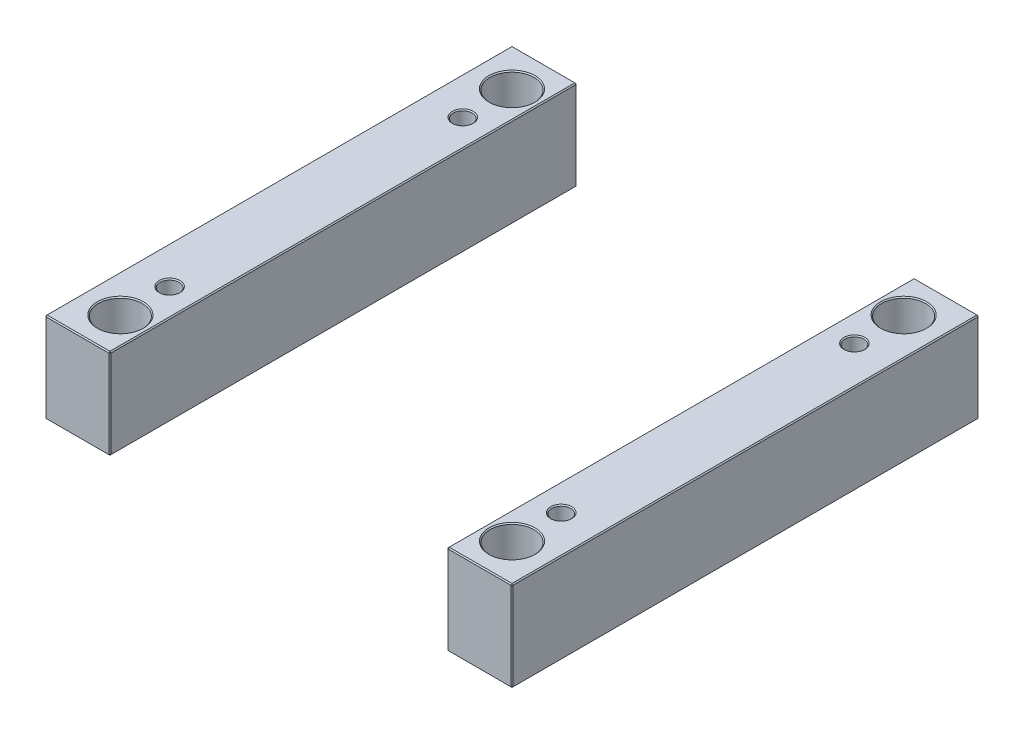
ISO-10303-21;
HEADER;
FILE_DESCRIPTION(('STEP AP214'),'2;1');
FILE_NAME('part.step','',(''),(''),'','','');
FILE_SCHEMA(('AUTOMOTIVE_DESIGN { 1 0 10303 214 1 1 1 1 }'));
ENDSEC;
DATA;
#1=APPLICATION_CONTEXT('core data for automotive mechanical design processes');
#2=APPLICATION_PROTOCOL_DEFINITION('international standard','automotive_design',2000,#1);
#3=PRODUCT_CONTEXT('',#1,'mechanical');
#4=PRODUCT('Part','Part','',(#3));
#5=PRODUCT_RELATED_PRODUCT_CATEGORY('part','',(#4));
#6=PRODUCT_DEFINITION_FORMATION('','',#4);
#7=PRODUCT_DEFINITION_CONTEXT('part definition',#1,'design');
#8=PRODUCT_DEFINITION('design','',#6,#7);
#9=PRODUCT_DEFINITION_SHAPE('','',#8);
#10=(LENGTH_UNIT() NAMED_UNIT(*) SI_UNIT(.MILLI.,.METRE.));
#11=(NAMED_UNIT(*) PLANE_ANGLE_UNIT() SI_UNIT($,.RADIAN.));
#12=(NAMED_UNIT(*) SI_UNIT($,.STERADIAN.) SOLID_ANGLE_UNIT());
#13=UNCERTAINTY_MEASURE_WITH_UNIT(LENGTH_MEASURE(1.E-05),#10,'distance_accuracy_value','');
#14=(GEOMETRIC_REPRESENTATION_CONTEXT(3) GLOBAL_UNCERTAINTY_ASSIGNED_CONTEXT((#13)) GLOBAL_UNIT_ASSIGNED_CONTEXT((#10,
#11,#12)) REPRESENTATION_CONTEXT('',''));
#15=CARTESIAN_POINT('',(0.,0.,0.));
#16=DIRECTION('',(0.,0.,1.));
#17=DIRECTION('',(1.,0.,0.));
#18=AXIS2_PLACEMENT_3D('',#15,#16,#17);
#19=CARTESIAN_POINT('',(-223.,86.,-223.));
#20=DIRECTION('',(0.,0.,1.));
#21=DIRECTION('',(1.,0.,0.));
#22=AXIS2_PLACEMENT_3D('',#19,#20,#21);
#23=PLANE('',#22);
#24=DIRECTION('',(-1.,0.,0.));
#25=VECTOR('',#24,1.);
#26=CARTESIAN_POINT('',(-223.,1.,-223.));
#27=LINE('',#26,#25);
#28=CARTESIAN_POINT('',(-162.,1.,-223.));
#29=VERTEX_POINT('',#28);
#30=CARTESIAN_POINT('',(-222.,1.,-223.));
#31=VERTEX_POINT('',#30);
#32=EDGE_CURVE('P0_E137',#29,#31,#27,.T.);
#33=ORIENTED_EDGE('',*,*,#32,.T.);
#34=DIRECTION('',(0.,1.,0.));
#35=VECTOR('',#34,1.);
#36=CARTESIAN_POINT('',(-222.,86.,-223.));
#37=LINE('',#36,#35);
#38=CARTESIAN_POINT('',(-222.,85.,-223.));
#39=VERTEX_POINT('',#38);
#40=EDGE_CURVE('P0_E265',#31,#39,#37,.T.);
#41=ORIENTED_EDGE('',*,*,#40,.T.);
#42=DIRECTION('',(1.,0.,0.));
#43=VECTOR('',#42,1.);
#44=CARTESIAN_POINT('',(-223.,85.,-223.));
#45=LINE('',#44,#43);
#46=CARTESIAN_POINT('',(-162.,85.,-223.));
#47=VERTEX_POINT('',#46);
#48=EDGE_CURVE('P0_E263',#39,#47,#45,.T.);
#49=ORIENTED_EDGE('',*,*,#48,.T.);
#50=DIRECTION('',(0.,-1.,0.));
#51=VECTOR('',#50,1.);
#52=CARTESIAN_POINT('',(-162.,86.,-223.));
#53=LINE('',#52,#51);
#54=EDGE_CURVE('P0_E260',#47,#29,#53,.T.);
#55=ORIENTED_EDGE('',*,*,#54,.T.);
#56=EDGE_LOOP('',(#33,#41,#49,#55));
#57=FACE_BOUND('',#56,.T.);
#58=ADVANCED_FACE('P0_F16',(#57),#23,.F.);
#59=CARTESIAN_POINT('',(-223.,86.,223.));
#60=DIRECTION('',(1.,0.,0.));
#61=DIRECTION('',(0.,0.,-1.));
#62=AXIS2_PLACEMENT_3D('',#59,#60,#61);
#63=PLANE('',#62);
#64=DIRECTION('',(0.,1.,0.));
#65=VECTOR('',#64,1.);
#66=CARTESIAN_POINT('',(-223.,86.,222.));
#67=LINE('',#66,#65);
#68=CARTESIAN_POINT('',(-223.,1.,222.));
#69=VERTEX_POINT('',#68);
#70=CARTESIAN_POINT('',(-223.,85.,222.));
#71=VERTEX_POINT('',#70);
#72=EDGE_CURVE('P0_E253',#69,#71,#67,.T.);
#73=ORIENTED_EDGE('',*,*,#72,.T.);
#74=DIRECTION('',(0.,0.,-1.));
#75=VECTOR('',#74,1.);
#76=CARTESIAN_POINT('',(-223.,85.,223.));
#77=LINE('',#76,#75);
#78=CARTESIAN_POINT('',(-223.,85.,-222.));
#79=VERTEX_POINT('',#78);
#80=EDGE_CURVE('P0_E258',#71,#79,#77,.T.);
#81=ORIENTED_EDGE('',*,*,#80,.T.);
#82=DIRECTION('',(0.,-1.,0.));
#83=VECTOR('',#82,1.);
#84=CARTESIAN_POINT('',(-223.,86.,-222.));
#85=LINE('',#84,#83);
#86=CARTESIAN_POINT('',(-223.,1.,-222.));
#87=VERTEX_POINT('',#86);
#88=EDGE_CURVE('P0_E255',#79,#87,#85,.T.);
#89=ORIENTED_EDGE('',*,*,#88,.T.);
#90=DIRECTION('',(0.,0.,1.));
#91=VECTOR('',#90,1.);
#92=CARTESIAN_POINT('',(-223.,1.,223.));
#93=LINE('',#92,#91);
#94=EDGE_CURVE('P0_E251',#87,#69,#93,.T.);
#95=ORIENTED_EDGE('',*,*,#94,.T.);
#96=EDGE_LOOP('',(#73,#81,#89,#95));
#97=FACE_BOUND('',#96,.T.);
#98=ADVANCED_FACE('P0_F333',(#97),#63,.F.);
#99=CARTESIAN_POINT('',(-223.,86.,223.));
#100=DIRECTION('',(0.,0.,-1.));
#101=DIRECTION('',(-1.,0.,0.));
#102=AXIS2_PLACEMENT_3D('',#99,#100,#101);
#103=PLANE('',#102);
#104=DIRECTION('',(-1.,0.,0.));
#105=VECTOR('',#104,1.);
#106=CARTESIAN_POINT('',(-223.,85.,223.));
#107=LINE('',#106,#105);
#108=CARTESIAN_POINT('',(-162.,85.,223.));
#109=VERTEX_POINT('',#108);
#110=CARTESIAN_POINT('',(-222.,85.,223.));
#111=VERTEX_POINT('',#110);
#112=EDGE_CURVE('P0_E272',#109,#111,#107,.T.);
#113=ORIENTED_EDGE('',*,*,#112,.T.);
#114=DIRECTION('',(0.,-1.,0.));
#115=VECTOR('',#114,1.);
#116=CARTESIAN_POINT('',(-222.,86.,223.));
#117=LINE('',#116,#115);
#118=CARTESIAN_POINT('',(-222.,1.,223.));
#119=VERTEX_POINT('',#118);
#120=EDGE_CURVE('P0_E274',#111,#119,#117,.T.);
#121=ORIENTED_EDGE('',*,*,#120,.T.);
#122=DIRECTION('',(1.,0.,0.));
#123=VECTOR('',#122,1.);
#124=CARTESIAN_POINT('',(-161.,1.,223.));
#125=LINE('',#124,#123);
#126=CARTESIAN_POINT('',(-162.,1.,223.));
#127=VERTEX_POINT('',#126);
#128=EDGE_CURVE('P0_E270',#119,#127,#125,.T.);
#129=ORIENTED_EDGE('',*,*,#128,.T.);
#130=DIRECTION('',(0.,1.,0.));
#131=VECTOR('',#130,1.);
#132=CARTESIAN_POINT('',(-162.,86.,223.));
#133=LINE('',#132,#131);
#134=EDGE_CURVE('P0_E268',#127,#109,#133,.T.);
#135=ORIENTED_EDGE('',*,*,#134,.T.);
#136=EDGE_LOOP('',(#113,#121,#129,#135));
#137=FACE_BOUND('',#136,.T.);
#138=ADVANCED_FACE('P0_F372',(#137),#103,.F.);
#139=CARTESIAN_POINT('',(-161.,86.,-223.));
#140=DIRECTION('',(-1.,0.,0.));
#141=DIRECTION('',(0.,0.,1.));
#142=AXIS2_PLACEMENT_3D('',#139,#140,#141);
#143=PLANE('',#142);
#144=DIRECTION('',(0.,0.,1.));
#145=VECTOR('',#144,1.);
#146=CARTESIAN_POINT('',(-161.,85.,-223.));
#147=LINE('',#146,#145);
#148=CARTESIAN_POINT('',(-161.,85.,-222.));
#149=VERTEX_POINT('',#148);
#150=CARTESIAN_POINT('',(-161.,85.,222.));
#151=VERTEX_POINT('',#150);
#152=EDGE_CURVE('P0_E31',#149,#151,#147,.T.);
#153=ORIENTED_EDGE('',*,*,#152,.T.);
#154=DIRECTION('',(0.,-1.,0.));
#155=VECTOR('',#154,1.);
#156=CARTESIAN_POINT('',(-161.,86.,222.));
#157=LINE('',#156,#155);
#158=CARTESIAN_POINT('',(-161.,1.,222.));
#159=VERTEX_POINT('',#158);
#160=EDGE_CURVE('P0_E190',#151,#159,#157,.T.);
#161=ORIENTED_EDGE('',*,*,#160,.T.);
#162=DIRECTION('',(0.,0.,-1.));
#163=VECTOR('',#162,1.);
#164=CARTESIAN_POINT('',(-161.,1.,-223.));
#165=LINE('',#164,#163);
#166=CARTESIAN_POINT('',(-161.,1.,-222.));
#167=VERTEX_POINT('',#166);
#168=EDGE_CURVE('P0_E286',#159,#167,#165,.T.);
#169=ORIENTED_EDGE('',*,*,#168,.T.);
#170=DIRECTION('',(0.,1.,0.));
#171=VECTOR('',#170,1.);
#172=CARTESIAN_POINT('',(-161.,86.,-222.));
#173=LINE('',#172,#171);
#174=EDGE_CURVE('P0_E36',#167,#149,#173,.T.);
#175=ORIENTED_EDGE('',*,*,#174,.T.);
#176=EDGE_LOOP('',(#153,#161,#169,#175));
#177=FACE_BOUND('',#176,.T.);
#178=ADVANCED_FACE('P0_F649',(#177),#143,.F.);
#179=CARTESIAN_POINT('',(0.,86.,0.));
#180=DIRECTION('',(0.,-1.,0.));
#181=DIRECTION('',(0.,0.,-1.));
#182=AXIS2_PLACEMENT_3D('',#179,#180,#181);
#183=PLANE('',#182);
#184=CARTESIAN_POINT('',(-187.,86.,-187.));
#185=DIRECTION('',(0.,-1.,0.));
#186=DIRECTION('',(0.,0.,-1.));
#187=AXIS2_PLACEMENT_3D('',#184,#185,#186);
#188=CIRCLE('',#187,22.);
#189=CARTESIAN_POINT('',(-187.,86.,-209.));
#190=VERTEX_POINT('',#189);
#191=EDGE_CURVE('P0_E214',#190,#190,#188,.T.);
#192=ORIENTED_EDGE('',*,*,#191,.T.);
#193=EDGE_LOOP('',(#192));
#194=FACE_BOUND('',#193,.T.);
#195=CARTESIAN_POINT('',(-187.,86.,187.));
#196=DIRECTION('',(0.,-1.,0.));
#197=DIRECTION('',(0.,0.,-1.));
#198=AXIS2_PLACEMENT_3D('',#195,#196,#197);
#199=CIRCLE('',#198,22.);
#200=CARTESIAN_POINT('',(-187.,86.,165.));
#201=VERTEX_POINT('',#200);
#202=EDGE_CURVE('P0_E211',#201,#201,#199,.T.);
#203=ORIENTED_EDGE('',*,*,#202,.T.);
#204=EDGE_LOOP('',(#203));
#205=FACE_BOUND('',#204,.T.);
#206=CARTESIAN_POINT('',(-187.,86.,140.));
#207=DIRECTION('',(0.,-1.,0.));
#208=DIRECTION('',(0.,0.,-1.));
#209=AXIS2_PLACEMENT_3D('',#206,#207,#208);
#210=CIRCLE('',#209,10.);
#211=CARTESIAN_POINT('',(-187.,86.,130.));
#212=VERTEX_POINT('',#211);
#213=EDGE_CURVE('P0_E193',#212,#212,#210,.T.);
#214=ORIENTED_EDGE('',*,*,#213,.T.);
#215=EDGE_LOOP('',(#214));
#216=FACE_BOUND('',#215,.T.);
#217=CARTESIAN_POINT('',(-187.,86.,-140.));
#218=DIRECTION('',(0.,-1.,0.));
#219=DIRECTION('',(0.,0.,-1.));
#220=AXIS2_PLACEMENT_3D('',#217,#218,#219);
#221=CIRCLE('',#220,10.);
#222=CARTESIAN_POINT('',(-187.,86.,-150.));
#223=VERTEX_POINT('',#222);
#224=EDGE_CURVE('P0_E189',#223,#223,#221,.T.);
#225=ORIENTED_EDGE('',*,*,#224,.T.);
#226=EDGE_LOOP('',(#225));
#227=FACE_BOUND('',#226,.T.);
#228=DIRECTION('',(0.,0.,1.));
#229=VECTOR('',#228,1.);
#230=CARTESIAN_POINT('',(-222.,86.,1.38155555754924E-13));
#231=LINE('',#230,#229);
#232=CARTESIAN_POINT('',(-222.,86.,-222.));
#233=VERTEX_POINT('',#232);
#234=CARTESIAN_POINT('',(-222.,86.,222.));
#235=VERTEX_POINT('',#234);
#236=EDGE_CURVE('P0_E281',#233,#235,#231,.T.);
#237=ORIENTED_EDGE('',*,*,#236,.T.);
#238=DIRECTION('',(1.,0.,0.));
#239=VECTOR('',#238,1.);
#240=CARTESIAN_POINT('',(-1.9876573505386E-13,86.,222.));
#241=LINE('',#240,#239);
#242=CARTESIAN_POINT('',(-162.,86.,222.));
#243=VERTEX_POINT('',#242);
#244=EDGE_CURVE('P0_E283',#235,#243,#241,.T.);
#245=ORIENTED_EDGE('',*,*,#244,.T.);
#246=DIRECTION('',(0.,0.,-1.));
#247=VECTOR('',#246,1.);
#248=CARTESIAN_POINT('',(-162.,86.,0.));
#249=LINE('',#248,#247);
#250=CARTESIAN_POINT('',(-162.,86.,-222.));
#251=VERTEX_POINT('',#250);
#252=EDGE_CURVE('P0_E277',#243,#251,#249,.T.);
#253=ORIENTED_EDGE('',*,*,#252,.T.);
#254=DIRECTION('',(-1.,0.,0.));
#255=VECTOR('',#254,1.);
#256=CARTESIAN_POINT('',(2.98148602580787E-13,86.,-222.));
#257=LINE('',#256,#255);
#258=EDGE_CURVE('P0_E279',#251,#233,#257,.T.);
#259=ORIENTED_EDGE('',*,*,#258,.T.);
#260=EDGE_LOOP('',(#237,#245,#253,#259));
#261=FACE_BOUND('',#260,.T.);
#262=ADVANCED_FACE('P0_F229',(#194,#205,#216,#227,#261),#183,.F.);
#263=CARTESIAN_POINT('',(0.,0.,0.));
#264=DIRECTION('',(0.,-1.,0.));
#265=DIRECTION('',(0.,0.,-1.));
#266=AXIS2_PLACEMENT_3D('',#263,#264,#265);
#267=PLANE('',#266);
#268=CARTESIAN_POINT('',(-187.,0.,-187.));
#269=DIRECTION('',(0.,-1.,0.));
#270=DIRECTION('',(0.,0.,-1.));
#271=AXIS2_PLACEMENT_3D('',#268,#269,#270);
#272=CIRCLE('',#271,22.);
#273=CARTESIAN_POINT('',(-187.,0.,-209.));
#274=VERTEX_POINT('',#273);
#275=EDGE_CURVE('P0_E202',#274,#274,#272,.F.);
#276=ORIENTED_EDGE('',*,*,#275,.T.);
#277=EDGE_LOOP('',(#276));
#278=FACE_BOUND('',#277,.T.);
#279=CARTESIAN_POINT('',(-187.,0.,187.));
#280=DIRECTION('',(0.,-1.,0.));
#281=DIRECTION('',(0.,0.,-1.));
#282=AXIS2_PLACEMENT_3D('',#279,#280,#281);
#283=CIRCLE('',#282,22.);
#284=CARTESIAN_POINT('',(-187.,0.,165.));
#285=VERTEX_POINT('',#284);
#286=EDGE_CURVE('P0_E199',#285,#285,#283,.F.);
#287=ORIENTED_EDGE('',*,*,#286,.T.);
#288=EDGE_LOOP('',(#287));
#289=FACE_BOUND('',#288,.T.);
#290=CARTESIAN_POINT('',(-187.,0.,-140.));
#291=DIRECTION('',(0.,-1.,0.));
#292=DIRECTION('',(0.,0.,-1.));
#293=AXIS2_PLACEMENT_3D('',#290,#291,#292);
#294=CIRCLE('',#293,10.);
#295=CARTESIAN_POINT('',(-187.,0.,-150.));
#296=VERTEX_POINT('',#295);
#297=EDGE_CURVE('P0_E235',#296,#296,#294,.F.);
#298=ORIENTED_EDGE('',*,*,#297,.T.);
#299=EDGE_LOOP('',(#298));
#300=FACE_BOUND('',#299,.T.);
#301=CARTESIAN_POINT('',(-187.,0.,140.));
#302=DIRECTION('',(0.,-1.,0.));
#303=DIRECTION('',(0.,0.,-1.));
#304=AXIS2_PLACEMENT_3D('',#301,#302,#303);
#305=CIRCLE('',#304,10.);
#306=CARTESIAN_POINT('',(-187.,0.,130.));
#307=VERTEX_POINT('',#306);
#308=EDGE_CURVE('P0_E238',#307,#307,#305,.F.);
#309=ORIENTED_EDGE('',*,*,#308,.T.);
#310=EDGE_LOOP('',(#309));
#311=FACE_BOUND('',#310,.T.);
#312=DIRECTION('',(-1.,0.,0.));
#313=VECTOR('',#312,1.);
#314=CARTESIAN_POINT('',(-223.,0.,222.));
#315=LINE('',#314,#313);
#316=CARTESIAN_POINT('',(-162.,0.,222.));
#317=VERTEX_POINT('',#316);
#318=CARTESIAN_POINT('',(-222.,0.,222.));
#319=VERTEX_POINT('',#318);
#320=EDGE_CURVE('P0_E114',#317,#319,#315,.T.);
#321=ORIENTED_EDGE('',*,*,#320,.T.);
#322=DIRECTION('',(0.,0.,-1.));
#323=VECTOR('',#322,1.);
#324=CARTESIAN_POINT('',(-222.,0.,-223.));
#325=LINE('',#324,#323);
#326=CARTESIAN_POINT('',(-222.,0.,-222.));
#327=VERTEX_POINT('',#326);
#328=EDGE_CURVE('P0_E110',#319,#327,#325,.T.);
#329=ORIENTED_EDGE('',*,*,#328,.T.);
#330=DIRECTION('',(1.,0.,0.));
#331=VECTOR('',#330,1.);
#332=CARTESIAN_POINT('',(-161.,0.,-222.));
#333=LINE('',#332,#331);
#334=CARTESIAN_POINT('',(-162.,0.,-222.));
#335=VERTEX_POINT('',#334);
#336=EDGE_CURVE('P0_E104',#327,#335,#333,.T.);
#337=ORIENTED_EDGE('',*,*,#336,.T.);
#338=DIRECTION('',(0.,0.,1.));
#339=VECTOR('',#338,1.);
#340=CARTESIAN_POINT('',(-162.,0.,223.));
#341=LINE('',#340,#339);
#342=EDGE_CURVE('P0_E107',#335,#317,#341,.T.);
#343=ORIENTED_EDGE('',*,*,#342,.T.);
#344=EDGE_LOOP('',(#321,#329,#337,#343));
#345=FACE_BOUND('',#344,.T.);
#346=ADVANCED_FACE('P0_F106',(#278,#289,#300,#311,#345),#267,.T.);
#347=CARTESIAN_POINT('',(-187.,0.,-140.));
#348=DIRECTION('',(0.,1.,0.));
#349=DIRECTION('',(0.,0.,1.));
#350=AXIS2_PLACEMENT_3D('',#347,#348,#349);
#351=CYLINDRICAL_SURFACE('',#350,9.);
#352=CARTESIAN_POINT('',(-187.,85.,-140.));
#353=DIRECTION('',(0.,-1.,0.));
#354=DIRECTION('',(0.,0.,-1.));
#355=AXIS2_PLACEMENT_3D('',#352,#353,#354);
#356=CIRCLE('',#355,9.);
#357=CARTESIAN_POINT('',(-187.,85.,-149.));
#358=VERTEX_POINT('',#357);
#359=EDGE_CURVE('P0_E196',#358,#358,#356,.F.);
#360=ORIENTED_EDGE('',*,*,#359,.T.);
#361=EDGE_LOOP('',(#360));
#362=FACE_BOUND('',#361,.T.);
#363=CARTESIAN_POINT('',(-187.,1.00000000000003,-140.));
#364=DIRECTION('',(0.,-1.,0.));
#365=DIRECTION('',(0.,0.,-1.));
#366=AXIS2_PLACEMENT_3D('',#363,#364,#365);
#367=CIRCLE('',#366,9.);
#368=CARTESIAN_POINT('',(-187.,1.00000000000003,-149.));
#369=VERTEX_POINT('',#368);
#370=EDGE_CURVE('P0_E241',#369,#369,#367,.T.);
#371=ORIENTED_EDGE('',*,*,#370,.T.);
#372=EDGE_LOOP('',(#371));
#373=FACE_BOUND('',#372,.T.);
#374=ADVANCED_FACE('P0_F228',(#362,#373),#351,.F.);
#375=CARTESIAN_POINT('',(-187.,0.,140.));
#376=DIRECTION('',(0.,1.,0.));
#377=DIRECTION('',(0.,0.,1.));
#378=AXIS2_PLACEMENT_3D('',#375,#376,#377);
#379=CYLINDRICAL_SURFACE('',#378,9.);
#380=CARTESIAN_POINT('',(-187.,85.,140.));
#381=DIRECTION('',(0.,-1.,0.));
#382=DIRECTION('',(0.,0.,-1.));
#383=AXIS2_PLACEMENT_3D('',#380,#381,#382);
#384=CIRCLE('',#383,9.);
#385=CARTESIAN_POINT('',(-187.,85.,131.));
#386=VERTEX_POINT('',#385);
#387=EDGE_CURVE('P0_E186',#386,#386,#384,.F.);
#388=ORIENTED_EDGE('',*,*,#387,.T.);
#389=EDGE_LOOP('',(#388));
#390=FACE_BOUND('',#389,.T.);
#391=CARTESIAN_POINT('',(-187.,1.00000000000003,140.));
#392=DIRECTION('',(0.,-1.,0.));
#393=DIRECTION('',(0.,0.,-1.));
#394=AXIS2_PLACEMENT_3D('',#391,#392,#393);
#395=CIRCLE('',#394,9.);
#396=CARTESIAN_POINT('',(-187.,1.00000000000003,131.));
#397=VERTEX_POINT('',#396);
#398=EDGE_CURVE('P0_E248',#397,#397,#395,.T.);
#399=ORIENTED_EDGE('',*,*,#398,.T.);
#400=EDGE_LOOP('',(#399));
#401=FACE_BOUND('',#400,.T.);
#402=ADVANCED_FACE('P0_F380',(#390,#401),#379,.F.);
#403=CARTESIAN_POINT('',(-187.,0.,-140.));
#404=DIRECTION('',(0.,-1.,0.));
#405=DIRECTION('',(0.,0.,-1.));
#406=AXIS2_PLACEMENT_3D('',#403,#404,#405);
#407=CONICAL_SURFACE('',#406,10.,0.785398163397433);
#408=ORIENTED_EDGE('',*,*,#370,.F.);
#409=EDGE_LOOP('',(#408));
#410=FACE_BOUND('',#409,.T.);
#411=ORIENTED_EDGE('',*,*,#297,.F.);
#412=EDGE_LOOP('',(#411));
#413=FACE_BOUND('',#412,.T.);
#414=ADVANCED_FACE('P0_F376',(#410,#413),#407,.F.);
#415=CARTESIAN_POINT('',(-187.,0.,140.));
#416=DIRECTION('',(0.,-1.,0.));
#417=DIRECTION('',(0.,0.,-1.));
#418=AXIS2_PLACEMENT_3D('',#415,#416,#417);
#419=CONICAL_SURFACE('',#418,10.,0.785398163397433);
#420=ORIENTED_EDGE('',*,*,#398,.F.);
#421=EDGE_LOOP('',(#420));
#422=FACE_BOUND('',#421,.T.);
#423=ORIENTED_EDGE('',*,*,#308,.F.);
#424=EDGE_LOOP('',(#423));
#425=FACE_BOUND('',#424,.T.);
#426=ADVANCED_FACE('P0_F379',(#422,#425),#419,.F.);
#427=CARTESIAN_POINT('',(-161.,86.,222.));
#428=DIRECTION('',(-0.707106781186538,0.,-0.707106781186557));
#429=DIRECTION('',(0.,-1.,0.));
#430=AXIS2_PLACEMENT_3D('',#427,#428,#429);
#431=PLANE('',#430);
#432=DIRECTION('',(-0.707106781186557,0.,0.707106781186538));
#433=VECTOR('',#432,1.);
#434=CARTESIAN_POINT('',(-161.5,85.,222.5));
#435=LINE('',#434,#433);
#436=EDGE_CURVE('P0_E125',#109,#151,#435,.F.);
#437=ORIENTED_EDGE('',*,*,#436,.F.);
#438=ORIENTED_EDGE('',*,*,#134,.F.);
#439=DIRECTION('',(0.707106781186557,0.,-0.707106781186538));
#440=VECTOR('',#439,1.);
#441=CARTESIAN_POINT('',(-162.,1.,223.));
#442=LINE('',#441,#440);
#443=EDGE_CURVE('P0_E181',#159,#127,#442,.F.);
#444=ORIENTED_EDGE('',*,*,#443,.F.);
#445=ORIENTED_EDGE('',*,*,#160,.F.);
#446=EDGE_LOOP('',(#437,#438,#444,#445));
#447=FACE_BOUND('',#446,.T.);
#448=ADVANCED_FACE('P0_F384',(#447),#431,.F.);
#449=CARTESIAN_POINT('',(-162.,86.,222.));
#450=DIRECTION('',(0.577350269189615,0.577350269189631,0.577350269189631));
#451=DIRECTION('',(0.,-0.707106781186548,0.707106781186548));
#452=AXIS2_PLACEMENT_3D('',#449,#450,#451);
#453=PLANE('',#452);
#454=DIRECTION('',(0.,0.707106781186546,-0.707106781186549));
#455=VECTOR('',#454,1.);
#456=CARTESIAN_POINT('',(-162.,86.,222.));
#457=LINE('',#456,#455);
#458=EDGE_CURVE('P0_E175',#109,#243,#457,.T.);
#459=ORIENTED_EDGE('',*,*,#458,.F.);
#460=ORIENTED_EDGE('',*,*,#436,.T.);
#461=DIRECTION('',(0.707106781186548,-0.707106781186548,0.));
#462=VECTOR('',#461,1.);
#463=CARTESIAN_POINT('',(-162.,86.,222.));
#464=LINE('',#463,#462);
#465=EDGE_CURVE('P0_E178',#243,#151,#464,.T.);
#466=ORIENTED_EDGE('',*,*,#465,.F.);
#467=EDGE_LOOP('',(#459,#460,#466));
#468=FACE_BOUND('',#467,.T.);
#469=ADVANCED_FACE('P0_F588',(#468),#453,.T.);
#470=CARTESIAN_POINT('',(-162.,1.,223.));
#471=DIRECTION('',(0.577350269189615,-0.577350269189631,0.577350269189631));
#472=DIRECTION('',(0.,-0.707106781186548,-0.707106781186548));
#473=AXIS2_PLACEMENT_3D('',#470,#471,#472);
#474=PLANE('',#473);
#475=DIRECTION('',(0.707106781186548,0.707106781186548,0.));
#476=VECTOR('',#475,1.);
#477=CARTESIAN_POINT('',(-161.5,0.500000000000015,222.));
#478=LINE('',#477,#476);
#479=EDGE_CURVE('P0_E123',#159,#317,#478,.F.);
#480=ORIENTED_EDGE('',*,*,#479,.F.);
#481=ORIENTED_EDGE('',*,*,#443,.T.);
#482=DIRECTION('',(0.,-0.707106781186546,-0.707106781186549));
#483=VECTOR('',#482,1.);
#484=CARTESIAN_POINT('',(-162.,1.,223.));
#485=LINE('',#484,#483);
#486=EDGE_CURVE('P0_E172',#317,#127,#485,.F.);
#487=ORIENTED_EDGE('',*,*,#486,.F.);
#488=EDGE_LOOP('',(#480,#481,#487));
#489=FACE_BOUND('',#488,.T.);
#490=ADVANCED_FACE('P0_F597',(#489),#474,.T.);
#491=CARTESIAN_POINT('',(-162.,86.,0.));
#492=DIRECTION('',(-0.707106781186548,-0.707106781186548,0.));
#493=DIRECTION('',(0.,0.,-1.));
#494=AXIS2_PLACEMENT_3D('',#491,#492,#493);
#495=PLANE('',#494);
#496=ORIENTED_EDGE('',*,*,#465,.T.);
#497=ORIENTED_EDGE('',*,*,#152,.F.);
#498=DIRECTION('',(-0.707106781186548,0.707106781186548,0.));
#499=VECTOR('',#498,1.);
#500=CARTESIAN_POINT('',(-161.5,85.5,-222.));
#501=LINE('',#500,#499);
#502=EDGE_CURVE('P0_E165',#251,#149,#501,.F.);
#503=ORIENTED_EDGE('',*,*,#502,.F.);
#504=ORIENTED_EDGE('',*,*,#252,.F.);
#505=EDGE_LOOP('',(#496,#497,#503,#504));
#506=FACE_BOUND('',#505,.T.);
#507=ADVANCED_FACE('P0_F349',(#506),#495,.F.);
#508=CARTESIAN_POINT('',(-1.9876573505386E-13,86.,222.));
#509=DIRECTION('',(0.,-0.707106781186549,-0.707106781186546));
#510=DIRECTION('',(1.,0.,0.));
#511=AXIS2_PLACEMENT_3D('',#508,#509,#510);
#512=PLANE('',#511);
#513=ORIENTED_EDGE('',*,*,#458,.T.);
#514=ORIENTED_EDGE('',*,*,#244,.F.);
#515=DIRECTION('',(0.,-0.707106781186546,0.707106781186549));
#516=VECTOR('',#515,1.);
#517=CARTESIAN_POINT('',(-222.,85.5,222.5));
#518=LINE('',#517,#516);
#519=EDGE_CURVE('P0_E162',#111,#235,#518,.F.);
#520=ORIENTED_EDGE('',*,*,#519,.F.);
#521=ORIENTED_EDGE('',*,*,#112,.F.);
#522=EDGE_LOOP('',(#513,#514,#520,#521));
#523=FACE_BOUND('',#522,.T.);
#524=ADVANCED_FACE('P0_F344',(#523),#512,.F.);
#525=CARTESIAN_POINT('',(-222.,86.,223.));
#526=DIRECTION('',(0.707106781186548,0.,-0.707106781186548));
#527=DIRECTION('',(0.,-1.,0.));
#528=AXIS2_PLACEMENT_3D('',#525,#526,#527);
#529=PLANE('',#528);
#530=DIRECTION('',(0.707106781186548,0.,0.707106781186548));
#531=VECTOR('',#530,1.);
#532=CARTESIAN_POINT('',(-222.,1.,223.));
#533=LINE('',#532,#531);
#534=EDGE_CURVE('P0_E156',#119,#69,#533,.F.);
#535=ORIENTED_EDGE('',*,*,#534,.F.);
#536=ORIENTED_EDGE('',*,*,#120,.F.);
#537=DIRECTION('',(-0.707106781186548,0.,-0.707106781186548));
#538=VECTOR('',#537,1.);
#539=CARTESIAN_POINT('',(-223.,85.,222.));
#540=LINE('',#539,#538);
#541=EDGE_CURVE('P0_E159',#71,#111,#540,.F.);
#542=ORIENTED_EDGE('',*,*,#541,.F.);
#543=ORIENTED_EDGE('',*,*,#72,.F.);
#544=EDGE_LOOP('',(#535,#536,#542,#543));
#545=FACE_BOUND('',#544,.T.);
#546=ADVANCED_FACE('P0_F338',(#545),#529,.F.);
#547=CARTESIAN_POINT('',(-223.,1.,223.));
#548=DIRECTION('',(0.,-0.707106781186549,0.707106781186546));
#549=DIRECTION('',(-1.,0.,0.));
#550=AXIS2_PLACEMENT_3D('',#547,#548,#549);
#551=PLANE('',#550);
#552=ORIENTED_EDGE('',*,*,#486,.T.);
#553=ORIENTED_EDGE('',*,*,#128,.F.);
#554=DIRECTION('',(0.,0.707106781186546,0.707106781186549));
#555=VECTOR('',#554,1.);
#556=CARTESIAN_POINT('',(-222.,1.,223.));
#557=LINE('',#556,#555);
#558=EDGE_CURVE('P0_E134',#319,#119,#557,.T.);
#559=ORIENTED_EDGE('',*,*,#558,.F.);
#560=ORIENTED_EDGE('',*,*,#320,.F.);
#561=EDGE_LOOP('',(#552,#553,#559,#560));
#562=FACE_BOUND('',#561,.T.);
#563=ADVANCED_FACE('P0_F364',(#562),#551,.T.);
#564=CARTESIAN_POINT('',(-161.,1.,-223.));
#565=DIRECTION('',(0.707106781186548,-0.707106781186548,0.));
#566=DIRECTION('',(0.,0.,1.));
#567=AXIS2_PLACEMENT_3D('',#564,#565,#566);
#568=PLANE('',#567);
#569=ORIENTED_EDGE('',*,*,#479,.T.);
#570=ORIENTED_EDGE('',*,*,#342,.F.);
#571=DIRECTION('',(-0.707106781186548,-0.707106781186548,0.));
#572=VECTOR('',#571,1.);
#573=CARTESIAN_POINT('',(-162.,0.,-222.));
#574=LINE('',#573,#572);
#575=EDGE_CURVE('P0_E120',#167,#335,#574,.T.);
#576=ORIENTED_EDGE('',*,*,#575,.F.);
#577=ORIENTED_EDGE('',*,*,#168,.F.);
#578=EDGE_LOOP('',(#569,#570,#576,#577));
#579=FACE_BOUND('',#578,.T.);
#580=ADVANCED_FACE('P0_F119',(#579),#568,.T.);
#581=CARTESIAN_POINT('',(-162.,86.,-223.));
#582=DIRECTION('',(-0.707106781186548,0.,0.707106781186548));
#583=DIRECTION('',(0.,-1.,0.));
#584=AXIS2_PLACEMENT_3D('',#581,#582,#583);
#585=PLANE('',#584);
#586=DIRECTION('',(0.707106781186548,0.,0.707106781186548));
#587=VECTOR('',#586,1.);
#588=CARTESIAN_POINT('',(-162.,85.,-223.));
#589=LINE('',#588,#587);
#590=EDGE_CURVE('P0_E168',#149,#47,#589,.F.);
#591=ORIENTED_EDGE('',*,*,#590,.F.);
#592=ORIENTED_EDGE('',*,*,#174,.F.);
#593=DIRECTION('',(-0.707106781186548,0.,-0.707106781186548));
#594=VECTOR('',#593,1.);
#595=CARTESIAN_POINT('',(-161.5,1.,-222.5));
#596=LINE('',#595,#594);
#597=EDGE_CURVE('P0_E133',#29,#167,#596,.F.);
#598=ORIENTED_EDGE('',*,*,#597,.F.);
#599=ORIENTED_EDGE('',*,*,#54,.F.);
#600=EDGE_LOOP('',(#591,#592,#598,#599));
#601=FACE_BOUND('',#600,.T.);
#602=ADVANCED_FACE('P0_F354',(#601),#585,.F.);
#603=CARTESIAN_POINT('',(-162.,85.,-223.));
#604=DIRECTION('',(0.577350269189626,0.577350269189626,-0.577350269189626));
#605=DIRECTION('',(-0.707106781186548,0.,-0.707106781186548));
#606=AXIS2_PLACEMENT_3D('',#603,#604,#605);
#607=PLANE('',#606);
#608=ORIENTED_EDGE('',*,*,#502,.T.);
#609=ORIENTED_EDGE('',*,*,#590,.T.);
#610=DIRECTION('',(0.,-0.707106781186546,-0.70710678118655));
#611=VECTOR('',#610,1.);
#612=CARTESIAN_POINT('',(-162.,85.,-223.));
#613=LINE('',#612,#611);
#614=EDGE_CURVE('P0_E151',#251,#47,#613,.T.);
#615=ORIENTED_EDGE('',*,*,#614,.F.);
#616=EDGE_LOOP('',(#608,#609,#615));
#617=FACE_BOUND('',#616,.T.);
#618=ADVANCED_FACE('P0_F352',(#617),#607,.T.);
#619=CARTESIAN_POINT('',(-223.,85.,222.));
#620=DIRECTION('',(-0.577350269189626,0.577350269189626,0.577350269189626));
#621=DIRECTION('',(0.707106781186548,0.,0.707106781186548));
#622=AXIS2_PLACEMENT_3D('',#619,#620,#621);
#623=PLANE('',#622);
#624=ORIENTED_EDGE('',*,*,#541,.T.);
#625=ORIENTED_EDGE('',*,*,#519,.T.);
#626=DIRECTION('',(0.707106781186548,0.707106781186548,0.));
#627=VECTOR('',#626,1.);
#628=CARTESIAN_POINT('',(-223.,85.,222.));
#629=LINE('',#628,#627);
#630=EDGE_CURVE('P0_E142',#71,#235,#629,.T.);
#631=ORIENTED_EDGE('',*,*,#630,.F.);
#632=EDGE_LOOP('',(#624,#625,#631));
#633=FACE_BOUND('',#632,.T.);
#634=ADVANCED_FACE('P0_F341',(#633),#623,.T.);
#635=CARTESIAN_POINT('',(-222.,1.,223.));
#636=DIRECTION('',(-0.577350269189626,-0.577350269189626,0.577350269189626));
#637=DIRECTION('',(0.707106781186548,0.,0.707106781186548));
#638=AXIS2_PLACEMENT_3D('',#635,#636,#637);
#639=PLANE('',#638);
#640=ORIENTED_EDGE('',*,*,#558,.T.);
#641=ORIENTED_EDGE('',*,*,#534,.T.);
#642=DIRECTION('',(0.707106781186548,-0.707106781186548,0.));
#643=VECTOR('',#642,1.);
#644=CARTESIAN_POINT('',(-222.5,0.5,222.));
#645=LINE('',#644,#643);
#646=EDGE_CURVE('P0_E138',#319,#69,#645,.F.);
#647=ORIENTED_EDGE('',*,*,#646,.F.);
#648=EDGE_LOOP('',(#640,#641,#647));
#649=FACE_BOUND('',#648,.T.);
#650=ADVANCED_FACE('P0_F403',(#649),#639,.T.);
#651=CARTESIAN_POINT('',(-162.,0.,-222.));
#652=DIRECTION('',(0.577350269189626,-0.577350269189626,-0.577350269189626));
#653=DIRECTION('',(-0.707106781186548,0.,-0.707106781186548));
#654=AXIS2_PLACEMENT_3D('',#651,#652,#653);
#655=PLANE('',#654);
#656=ORIENTED_EDGE('',*,*,#597,.T.);
#657=ORIENTED_EDGE('',*,*,#575,.T.);
#658=DIRECTION('',(0.,0.707106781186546,-0.70710678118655));
#659=VECTOR('',#658,1.);
#660=CARTESIAN_POINT('',(-162.,0.,-222.));
#661=LINE('',#660,#659);
#662=EDGE_CURVE('P0_E130',#29,#335,#661,.F.);
#663=ORIENTED_EDGE('',*,*,#662,.F.);
#664=EDGE_LOOP('',(#656,#657,#663));
#665=FACE_BOUND('',#664,.T.);
#666=ADVANCED_FACE('P0_F129',(#665),#655,.T.);
#667=CARTESIAN_POINT('',(2.98148602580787E-13,86.,-222.));
#668=DIRECTION('',(0.,-0.70710678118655,0.707106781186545));
#669=DIRECTION('',(-1.,0.,0.));
#670=AXIS2_PLACEMENT_3D('',#667,#668,#669);
#671=PLANE('',#670);
#672=ORIENTED_EDGE('',*,*,#614,.T.);
#673=ORIENTED_EDGE('',*,*,#48,.F.);
#674=DIRECTION('',(0.,0.707106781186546,0.707106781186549));
#675=VECTOR('',#674,1.);
#676=CARTESIAN_POINT('',(-222.,85.,-223.));
#677=LINE('',#676,#675);
#678=EDGE_CURVE('P0_E139',#233,#39,#677,.F.);
#679=ORIENTED_EDGE('',*,*,#678,.F.);
#680=ORIENTED_EDGE('',*,*,#258,.F.);
#681=EDGE_LOOP('',(#672,#673,#679,#680));
#682=FACE_BOUND('',#681,.T.);
#683=ADVANCED_FACE('P0_F316',(#682),#671,.F.);
#684=CARTESIAN_POINT('',(-222.,86.,1.38155555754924E-13));
#685=DIRECTION('',(0.707106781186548,-0.707106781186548,0.));
#686=DIRECTION('',(0.,0.,1.));
#687=AXIS2_PLACEMENT_3D('',#684,#685,#686);
#688=PLANE('',#687);
#689=ORIENTED_EDGE('',*,*,#630,.T.);
#690=ORIENTED_EDGE('',*,*,#236,.F.);
#691=DIRECTION('',(-0.707106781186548,-0.707106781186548,0.));
#692=VECTOR('',#691,1.);
#693=CARTESIAN_POINT('',(-222.5,85.5,-222.));
#694=LINE('',#693,#692);
#695=EDGE_CURVE('P0_E145',#79,#233,#694,.F.);
#696=ORIENTED_EDGE('',*,*,#695,.F.);
#697=ORIENTED_EDGE('',*,*,#80,.F.);
#698=EDGE_LOOP('',(#689,#690,#696,#697));
#699=FACE_BOUND('',#698,.T.);
#700=ADVANCED_FACE('P0_F310',(#699),#688,.F.);
#701=CARTESIAN_POINT('',(-223.,1.,223.));
#702=DIRECTION('',(-0.707106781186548,-0.707106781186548,0.));
#703=DIRECTION('',(0.,0.,-1.));
#704=AXIS2_PLACEMENT_3D('',#701,#702,#703);
#705=PLANE('',#704);
#706=ORIENTED_EDGE('',*,*,#646,.T.);
#707=ORIENTED_EDGE('',*,*,#94,.F.);
#708=DIRECTION('',(-0.707106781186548,0.707106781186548,0.));
#709=VECTOR('',#708,1.);
#710=CARTESIAN_POINT('',(-223.,1.,-222.));
#711=LINE('',#710,#709);
#712=EDGE_CURVE('P0_E297',#327,#87,#711,.T.);
#713=ORIENTED_EDGE('',*,*,#712,.F.);
#714=ORIENTED_EDGE('',*,*,#328,.F.);
#715=EDGE_LOOP('',(#706,#707,#713,#714));
#716=FACE_BOUND('',#715,.T.);
#717=ADVANCED_FACE('P0_F329',(#716),#705,.T.);
#718=CARTESIAN_POINT('',(-223.,1.,-223.));
#719=DIRECTION('',(0.,-0.70710678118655,-0.707106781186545));
#720=DIRECTION('',(1.,0.,0.));
#721=AXIS2_PLACEMENT_3D('',#718,#719,#720);
#722=PLANE('',#721);
#723=ORIENTED_EDGE('',*,*,#662,.T.);
#724=ORIENTED_EDGE('',*,*,#336,.F.);
#725=DIRECTION('',(0.,-0.707106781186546,0.707106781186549));
#726=VECTOR('',#725,1.);
#727=CARTESIAN_POINT('',(-222.,0.5,-222.5));
#728=LINE('',#727,#726);
#729=EDGE_CURVE('P0_E295',#31,#327,#728,.T.);
#730=ORIENTED_EDGE('',*,*,#729,.F.);
#731=ORIENTED_EDGE('',*,*,#32,.F.);
#732=EDGE_LOOP('',(#723,#724,#730,#731));
#733=FACE_BOUND('',#732,.T.);
#734=ADVANCED_FACE('P0_F136',(#733),#722,.T.);
#735=CARTESIAN_POINT('',(-222.,85.,-223.));
#736=DIRECTION('',(-0.577350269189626,0.577350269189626,-0.577350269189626));
#737=DIRECTION('',(-0.707106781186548,0.,0.707106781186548));
#738=AXIS2_PLACEMENT_3D('',#735,#736,#737);
#739=PLANE('',#738);
#740=ORIENTED_EDGE('',*,*,#695,.T.);
#741=ORIENTED_EDGE('',*,*,#678,.T.);
#742=DIRECTION('',(0.707106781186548,0.,-0.707106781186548));
#743=VECTOR('',#742,1.);
#744=CARTESIAN_POINT('',(-222.,85.,-223.));
#745=LINE('',#744,#743);
#746=EDGE_CURVE('P0_E293',#79,#39,#745,.T.);
#747=ORIENTED_EDGE('',*,*,#746,.F.);
#748=EDGE_LOOP('',(#740,#741,#747));
#749=FACE_BOUND('',#748,.T.);
#750=ADVANCED_FACE('P0_F303',(#749),#739,.T.);
#751=CARTESIAN_POINT('',(-223.,1.,-222.));
#752=DIRECTION('',(-0.577350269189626,-0.577350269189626,-0.577350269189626));
#753=DIRECTION('',(-0.707106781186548,0.,0.707106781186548));
#754=AXIS2_PLACEMENT_3D('',#751,#752,#753);
#755=PLANE('',#754);
#756=ORIENTED_EDGE('',*,*,#729,.T.);
#757=ORIENTED_EDGE('',*,*,#712,.T.);
#758=DIRECTION('',(-0.707106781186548,0.,0.707106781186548));
#759=VECTOR('',#758,1.);
#760=CARTESIAN_POINT('',(-223.,1.,-222.));
#761=LINE('',#760,#759);
#762=EDGE_CURVE('P0_E291',#31,#87,#761,.T.);
#763=ORIENTED_EDGE('',*,*,#762,.F.);
#764=EDGE_LOOP('',(#756,#757,#763));
#765=FACE_BOUND('',#764,.T.);
#766=ADVANCED_FACE('P0_F325',(#765),#755,.T.);
#767=CARTESIAN_POINT('',(-223.,86.,-222.));
#768=DIRECTION('',(0.707106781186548,0.,0.707106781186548));
#769=DIRECTION('',(0.,-1.,0.));
#770=AXIS2_PLACEMENT_3D('',#767,#768,#769);
#771=PLANE('',#770);
#772=ORIENTED_EDGE('',*,*,#746,.T.);
#773=ORIENTED_EDGE('',*,*,#40,.F.);
#774=ORIENTED_EDGE('',*,*,#762,.T.);
#775=ORIENTED_EDGE('',*,*,#88,.F.);
#776=EDGE_LOOP('',(#772,#773,#774,#775));
#777=FACE_BOUND('',#776,.T.);
#778=ADVANCED_FACE('P0_F323',(#777),#771,.F.);
#779=CARTESIAN_POINT('',(-187.,85.,140.));
#780=DIRECTION('',(0.,1.,0.));
#781=DIRECTION('',(0.,0.,1.));
#782=AXIS2_PLACEMENT_3D('',#779,#780,#781);
#783=CONICAL_SURFACE('',#782,9.,0.785398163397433);
#784=ORIENTED_EDGE('',*,*,#213,.F.);
#785=EDGE_LOOP('',(#784));
#786=FACE_BOUND('',#785,.T.);
#787=ORIENTED_EDGE('',*,*,#387,.F.);
#788=EDGE_LOOP('',(#787));
#789=FACE_BOUND('',#788,.T.);
#790=ADVANCED_FACE('P0_F388',(#786,#789),#783,.F.);
#791=CARTESIAN_POINT('',(-187.,85.,-140.));
#792=DIRECTION('',(0.,1.,0.));
#793=DIRECTION('',(0.,0.,1.));
#794=AXIS2_PLACEMENT_3D('',#791,#792,#793);
#795=CONICAL_SURFACE('',#794,9.,0.785398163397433);
#796=ORIENTED_EDGE('',*,*,#224,.F.);
#797=EDGE_LOOP('',(#796));
#798=FACE_BOUND('',#797,.T.);
#799=ORIENTED_EDGE('',*,*,#359,.F.);
#800=EDGE_LOOP('',(#799));
#801=FACE_BOUND('',#800,.T.);
#802=ADVANCED_FACE('P0_F470',(#798,#801),#795,.F.);
#803=CARTESIAN_POINT('',(-187.,0.,187.));
#804=DIRECTION('',(0.,1.,0.));
#805=DIRECTION('',(0.,0.,1.));
#806=AXIS2_PLACEMENT_3D('',#803,#804,#805);
#807=CYLINDRICAL_SURFACE('',#806,21.);
#808=CARTESIAN_POINT('',(-187.,85.,187.));
#809=DIRECTION('',(0.,-1.,0.));
#810=DIRECTION('',(0.,0.,-1.));
#811=AXIS2_PLACEMENT_3D('',#808,#809,#810);
#812=CIRCLE('',#811,21.);
#813=CARTESIAN_POINT('',(-187.,85.,166.));
#814=VERTEX_POINT('',#813);
#815=EDGE_CURVE('P0_E10',#814,#814,#812,.F.);
#816=ORIENTED_EDGE('',*,*,#815,.T.);
#817=EDGE_LOOP('',(#816));
#818=FACE_BOUND('',#817,.T.);
#819=CARTESIAN_POINT('',(-187.,0.999999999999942,187.));
#820=DIRECTION('',(0.,-1.,0.));
#821=DIRECTION('',(0.,0.,-1.));
#822=AXIS2_PLACEMENT_3D('',#819,#820,#821);
#823=CIRCLE('',#822,21.);
#824=CARTESIAN_POINT('',(-187.,0.999999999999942,166.));
#825=VERTEX_POINT('',#824);
#826=EDGE_CURVE('P0_E24',#825,#825,#823,.T.);
#827=ORIENTED_EDGE('',*,*,#826,.T.);
#828=EDGE_LOOP('',(#827));
#829=FACE_BOUND('',#828,.T.);
#830=ADVANCED_FACE('P0_F219',(#818,#829),#807,.F.);
#831=CARTESIAN_POINT('',(-187.,0.,-187.));
#832=DIRECTION('',(0.,1.,0.));
#833=DIRECTION('',(0.,0.,1.));
#834=AXIS2_PLACEMENT_3D('',#831,#832,#833);
#835=CYLINDRICAL_SURFACE('',#834,21.);
#836=CARTESIAN_POINT('',(-187.,1.,-187.));
#837=DIRECTION('',(0.,-1.,0.));
#838=DIRECTION('',(0.,0.,-1.));
#839=AXIS2_PLACEMENT_3D('',#836,#837,#838);
#840=CIRCLE('',#839,21.);
#841=CARTESIAN_POINT('',(-187.,1.,-208.));
#842=VERTEX_POINT('',#841);
#843=EDGE_CURVE('P0_E208',#842,#842,#840,.T.);
#844=ORIENTED_EDGE('',*,*,#843,.T.);
#845=EDGE_LOOP('',(#844));
#846=FACE_BOUND('',#845,.T.);
#847=CARTESIAN_POINT('',(-187.,85.,-187.));
#848=DIRECTION('',(0.,-1.,0.));
#849=DIRECTION('',(0.,0.,-1.));
#850=AXIS2_PLACEMENT_3D('',#847,#848,#849);
#851=CIRCLE('',#850,21.);
#852=CARTESIAN_POINT('',(-187.,85.,-208.));
#853=VERTEX_POINT('',#852);
#854=EDGE_CURVE('P0_E205',#853,#853,#851,.F.);
#855=ORIENTED_EDGE('',*,*,#854,.T.);
#856=EDGE_LOOP('',(#855));
#857=FACE_BOUND('',#856,.T.);
#858=ADVANCED_FACE('P0_F487',(#846,#857),#835,.F.);
#859=CARTESIAN_POINT('',(-187.,0.,-187.));
#860=DIRECTION('',(0.,-1.,0.));
#861=DIRECTION('',(0.,0.,-1.));
#862=AXIS2_PLACEMENT_3D('',#859,#860,#861);
#863=CONICAL_SURFACE('',#862,22.,0.785398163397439);
#864=ORIENTED_EDGE('',*,*,#843,.F.);
#865=EDGE_LOOP('',(#864));
#866=FACE_BOUND('',#865,.T.);
#867=ORIENTED_EDGE('',*,*,#275,.F.);
#868=EDGE_LOOP('',(#867));
#869=FACE_BOUND('',#868,.T.);
#870=ADVANCED_FACE('P0_F496',(#866,#869),#863,.F.);
#871=CARTESIAN_POINT('',(-187.,85.,-187.));
#872=DIRECTION('',(0.,1.,0.));
#873=DIRECTION('',(0.,0.,1.));
#874=AXIS2_PLACEMENT_3D('',#871,#872,#873);
#875=CONICAL_SURFACE('',#874,21.,0.785398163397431);
#876=ORIENTED_EDGE('',*,*,#191,.F.);
#877=EDGE_LOOP('',(#876));
#878=FACE_BOUND('',#877,.T.);
#879=ORIENTED_EDGE('',*,*,#854,.F.);
#880=EDGE_LOOP('',(#879));
#881=FACE_BOUND('',#880,.T.);
#882=ADVANCED_FACE('P0_F505',(#878,#881),#875,.F.);
#883=CARTESIAN_POINT('',(-187.,85.,187.));
#884=DIRECTION('',(0.,1.,0.));
#885=DIRECTION('',(0.,0.,1.));
#886=AXIS2_PLACEMENT_3D('',#883,#884,#885);
#887=CONICAL_SURFACE('',#886,21.,0.785398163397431);
#888=ORIENTED_EDGE('',*,*,#202,.F.);
#889=EDGE_LOOP('',(#888));
#890=FACE_BOUND('',#889,.T.);
#891=ORIENTED_EDGE('',*,*,#815,.F.);
#892=EDGE_LOOP('',(#891));
#893=FACE_BOUND('',#892,.T.);
#894=ADVANCED_FACE('P0_F223',(#890,#893),#887,.F.);
#895=CARTESIAN_POINT('',(-187.,0.,187.));
#896=DIRECTION('',(0.,-1.,0.));
#897=DIRECTION('',(0.,0.,-1.));
#898=AXIS2_PLACEMENT_3D('',#895,#896,#897);
#899=CONICAL_SURFACE('',#898,22.,0.785398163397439);
#900=ORIENTED_EDGE('',*,*,#826,.F.);
#901=EDGE_LOOP('',(#900));
#902=FACE_BOUND('',#901,.T.);
#903=ORIENTED_EDGE('',*,*,#286,.F.);
#904=EDGE_LOOP('',(#903));
#905=FACE_BOUND('',#904,.T.);
#906=ADVANCED_FACE('P0_F18',(#902,#905),#899,.F.);
#907=CLOSED_SHELL('',(#58,#98,#138,#178,#262,#346,#374,#402,#414,#426,#448,#469,#490,#507,#524,
#546,#563,#580,#602,#618,#634,#650,#666,#683,#700,#717,#734,#750,#766,#778,#790,#802,#830,#858,
#870,#882,#894,#906));
#908=MANIFOLD_SOLID_BREP('P0_B1',#907);
#909=CARTESIAN_POINT('',(223.,86.,223.));
#910=DIRECTION('',(0.,0.,-1.));
#911=DIRECTION('',(-1.,0.,0.));
#912=AXIS2_PLACEMENT_3D('',#909,#910,#911);
#913=PLANE('',#912);
#914=DIRECTION('',(0.,-1.,0.));
#915=VECTOR('',#914,1.);
#916=CARTESIAN_POINT('',(162.,86.,223.));
#917=LINE('',#916,#915);
#918=CARTESIAN_POINT('',(162.,85.,223.));
#919=VERTEX_POINT('',#918);
#920=CARTESIAN_POINT('',(162.,1.,223.));
#921=VERTEX_POINT('',#920);
#922=EDGE_CURVE('P1_E175',#919,#921,#917,.T.);
#923=ORIENTED_EDGE('',*,*,#922,.T.);
#924=DIRECTION('',(1.,0.,0.));
#925=VECTOR('',#924,1.);
#926=CARTESIAN_POINT('',(223.,1.,223.));
#927=LINE('',#926,#925);
#928=CARTESIAN_POINT('',(222.,1.,223.));
#929=VERTEX_POINT('',#928);
#930=EDGE_CURVE('P1_E177',#921,#929,#927,.T.);
#931=ORIENTED_EDGE('',*,*,#930,.T.);
#932=DIRECTION('',(0.,1.,0.));
#933=VECTOR('',#932,1.);
#934=CARTESIAN_POINT('',(222.,86.,223.));
#935=LINE('',#934,#933);
#936=CARTESIAN_POINT('',(222.,85.,223.));
#937=VERTEX_POINT('',#936);
#938=EDGE_CURVE('P1_E173',#929,#937,#935,.T.);
#939=ORIENTED_EDGE('',*,*,#938,.T.);
#940=DIRECTION('',(-1.,0.,0.));
#941=VECTOR('',#940,1.);
#942=CARTESIAN_POINT('',(161.,85.,223.));
#943=LINE('',#942,#941);
#944=EDGE_CURVE('P1_E171',#937,#919,#943,.T.);
#945=ORIENTED_EDGE('',*,*,#944,.T.);
#946=EDGE_LOOP('',(#923,#931,#939,#945));
#947=FACE_BOUND('',#946,.T.);
#948=ADVANCED_FACE('P1_F17',(#947),#913,.F.);
#949=CARTESIAN_POINT('',(223.,86.,223.));
#950=DIRECTION('',(-1.,0.,0.));
#951=DIRECTION('',(0.,0.,1.));
#952=AXIS2_PLACEMENT_3D('',#949,#950,#951);
#953=PLANE('',#952);
#954=DIRECTION('',(0.,0.,1.));
#955=VECTOR('',#954,1.);
#956=CARTESIAN_POINT('',(223.,85.,223.));
#957=LINE('',#956,#955);
#958=CARTESIAN_POINT('',(223.,85.,-222.));
#959=VERTEX_POINT('',#958);
#960=CARTESIAN_POINT('',(223.,85.,222.));
#961=VERTEX_POINT('',#960);
#962=EDGE_CURVE('P1_E189',#959,#961,#957,.T.);
#963=ORIENTED_EDGE('',*,*,#962,.T.);
#964=DIRECTION('',(0.,-1.,0.));
#965=VECTOR('',#964,1.);
#966=CARTESIAN_POINT('',(223.,86.,222.));
#967=LINE('',#966,#965);
#968=CARTESIAN_POINT('',(223.,1.00000000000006,222.));
#969=VERTEX_POINT('',#968);
#970=EDGE_CURVE('P1_E195',#961,#969,#967,.T.);
#971=ORIENTED_EDGE('',*,*,#970,.T.);
#972=DIRECTION('',(0.,0.,-1.));
#973=VECTOR('',#972,1.);
#974=CARTESIAN_POINT('',(223.,1.00000000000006,223.));
#975=LINE('',#974,#973);
#976=CARTESIAN_POINT('',(223.,1.00000000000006,-222.));
#977=VERTEX_POINT('',#976);
#978=EDGE_CURVE('P1_E193',#969,#977,#975,.T.);
#979=ORIENTED_EDGE('',*,*,#978,.T.);
#980=DIRECTION('',(0.,1.,0.));
#981=VECTOR('',#980,1.);
#982=CARTESIAN_POINT('',(223.,86.,-222.));
#983=LINE('',#982,#981);
#984=EDGE_CURVE('P1_E191',#977,#959,#983,.T.);
#985=ORIENTED_EDGE('',*,*,#984,.T.);
#986=EDGE_LOOP('',(#963,#971,#979,#985));
#987=FACE_BOUND('',#986,.T.);
#988=ADVANCED_FACE('P1_F322',(#987),#953,.F.);
#989=CARTESIAN_POINT('',(223.,86.,-223.));
#990=DIRECTION('',(0.,0.,1.));
#991=DIRECTION('',(1.,0.,0.));
#992=AXIS2_PLACEMENT_3D('',#989,#990,#991);
#993=PLANE('',#992);
#994=DIRECTION('',(0.,-1.,0.));
#995=VECTOR('',#994,1.);
#996=CARTESIAN_POINT('',(222.,86.,-223.));
#997=LINE('',#996,#995);
#998=CARTESIAN_POINT('',(222.,85.,-223.));
#999=VERTEX_POINT('',#998);
#1000=CARTESIAN_POINT('',(222.,1.00000000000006,-223.));
#1001=VERTEX_POINT('',#1000);
#1002=EDGE_CURVE('P1_E166',#999,#1001,#997,.T.);
#1003=ORIENTED_EDGE('',*,*,#1002,.T.);
#1004=DIRECTION('',(-1.,0.,0.));
#1005=VECTOR('',#1004,1.);
#1006=CARTESIAN_POINT('',(223.,1.00000000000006,-223.));
#1007=LINE('',#1006,#1005);
#1008=CARTESIAN_POINT('',(162.,1.00000000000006,-223.));
#1009=VERTEX_POINT('',#1008);
#1010=EDGE_CURVE('P1_E113',#1001,#1009,#1007,.T.);
#1011=ORIENTED_EDGE('',*,*,#1010,.T.);
#1012=DIRECTION('',(0.,1.,0.));
#1013=VECTOR('',#1012,1.);
#1014=CARTESIAN_POINT('',(162.,86.,-223.));
#1015=LINE('',#1014,#1013);
#1016=CARTESIAN_POINT('',(162.,85.,-223.));
#1017=VERTEX_POINT('',#1016);
#1018=EDGE_CURVE('P1_E168',#1009,#1017,#1015,.T.);
#1019=ORIENTED_EDGE('',*,*,#1018,.T.);
#1020=DIRECTION('',(1.,0.,0.));
#1021=VECTOR('',#1020,1.);
#1022=CARTESIAN_POINT('',(223.,85.,-223.));
#1023=LINE('',#1022,#1021);
#1024=EDGE_CURVE('P1_E164',#1017,#999,#1023,.T.);
#1025=ORIENTED_EDGE('',*,*,#1024,.T.);
#1026=EDGE_LOOP('',(#1003,#1011,#1019,#1025));
#1027=FACE_BOUND('',#1026,.T.);
#1028=ADVANCED_FACE('P1_F329',(#1027),#993,.F.);
#1029=CARTESIAN_POINT('',(161.,86.,-223.));
#1030=DIRECTION('',(1.,0.,0.));
#1031=DIRECTION('',(0.,0.,-1.));
#1032=AXIS2_PLACEMENT_3D('',#1029,#1030,#1031);
#1033=PLANE('',#1032);
#1034=DIRECTION('',(0.,0.,-1.));
#1035=VECTOR('',#1034,1.);
#1036=CARTESIAN_POINT('',(161.,85.,-223.));
#1037=LINE('',#1036,#1035);
#1038=CARTESIAN_POINT('',(161.,85.,222.));
#1039=VERTEX_POINT('',#1038);
#1040=CARTESIAN_POINT('',(161.,85.,-222.));
#1041=VERTEX_POINT('',#1040);
#1042=EDGE_CURVE('P1_E180',#1039,#1041,#1037,.T.);
#1043=ORIENTED_EDGE('',*,*,#1042,.T.);
#1044=DIRECTION('',(0.,-1.,0.));
#1045=VECTOR('',#1044,1.);
#1046=CARTESIAN_POINT('',(161.,86.,-222.));
#1047=LINE('',#1046,#1045);
#1048=CARTESIAN_POINT('',(161.,1.00000000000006,-222.));
#1049=VERTEX_POINT('',#1048);
#1050=EDGE_CURVE('P1_E186',#1041,#1049,#1047,.T.);
#1051=ORIENTED_EDGE('',*,*,#1050,.T.);
#1052=DIRECTION('',(0.,0.,1.));
#1053=VECTOR('',#1052,1.);
#1054=CARTESIAN_POINT('',(161.,1.00000000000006,-223.));
#1055=LINE('',#1054,#1053);
#1056=CARTESIAN_POINT('',(161.,1.00000000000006,222.));
#1057=VERTEX_POINT('',#1056);
#1058=EDGE_CURVE('P1_E184',#1049,#1057,#1055,.T.);
#1059=ORIENTED_EDGE('',*,*,#1058,.T.);
#1060=DIRECTION('',(0.,1.,0.));
#1061=VECTOR('',#1060,1.);
#1062=CARTESIAN_POINT('',(161.,86.,222.));
#1063=LINE('',#1062,#1061);
#1064=EDGE_CURVE('P1_E182',#1057,#1039,#1063,.T.);
#1065=ORIENTED_EDGE('',*,*,#1064,.T.);
#1066=EDGE_LOOP('',(#1043,#1051,#1059,#1065));
#1067=FACE_BOUND('',#1066,.T.);
#1068=ADVANCED_FACE('P1_F335',(#1067),#1033,.F.);
#1069=CARTESIAN_POINT('',(0.,86.,0.));
#1070=DIRECTION('',(0.,1.,0.));
#1071=DIRECTION('',(0.,0.,1.));
#1072=AXIS2_PLACEMENT_3D('',#1069,#1070,#1071);
#1073=PLANE('',#1072);
#1074=CARTESIAN_POINT('',(187.,86.,187.));
#1075=DIRECTION('',(0.,1.,0.));
#1076=DIRECTION('',(0.,0.,1.));
#1077=AXIS2_PLACEMENT_3D('',#1074,#1075,#1076);
#1078=CIRCLE('',#1077,22.);
#1079=CARTESIAN_POINT('',(187.,86.,209.));
#1080=VERTEX_POINT('',#1079);
#1081=EDGE_CURVE('P1_E273',#1080,#1080,#1078,.F.);
#1082=ORIENTED_EDGE('',*,*,#1081,.T.);
#1083=EDGE_LOOP('',(#1082));
#1084=FACE_BOUND('',#1083,.T.);
#1085=CARTESIAN_POINT('',(187.,86.,-187.));
#1086=DIRECTION('',(0.,1.,0.));
#1087=DIRECTION('',(0.,0.,1.));
#1088=AXIS2_PLACEMENT_3D('',#1085,#1086,#1087);
#1089=CIRCLE('',#1088,22.);
#1090=CARTESIAN_POINT('',(187.,86.,-165.));
#1091=VERTEX_POINT('',#1090);
#1092=EDGE_CURVE('P1_E270',#1091,#1091,#1089,.F.);
#1093=ORIENTED_EDGE('',*,*,#1092,.T.);
#1094=EDGE_LOOP('',(#1093));
#1095=FACE_BOUND('',#1094,.T.);
#1096=DIRECTION('',(-1.,0.,0.));
#1097=VECTOR('',#1096,1.);
#1098=CARTESIAN_POINT('',(161.,86.,-222.));
#1099=LINE('',#1098,#1097);
#1100=CARTESIAN_POINT('',(222.,86.,-222.));
#1101=VERTEX_POINT('',#1100);
#1102=CARTESIAN_POINT('',(162.,86.,-222.));
#1103=VERTEX_POINT('',#1102);
#1104=EDGE_CURVE('P1_E32',#1101,#1103,#1099,.T.);
#1105=ORIENTED_EDGE('',*,*,#1104,.T.);
#1106=DIRECTION('',(0.,0.,1.));
#1107=VECTOR('',#1106,1.);
#1108=CARTESIAN_POINT('',(162.,86.,223.));
#1109=LINE('',#1108,#1107);
#1110=CARTESIAN_POINT('',(162.,86.,222.));
#1111=VERTEX_POINT('',#1110);
#1112=EDGE_CURVE('P1_E208',#1103,#1111,#1109,.T.);
#1113=ORIENTED_EDGE('',*,*,#1112,.T.);
#1114=DIRECTION('',(1.,0.,0.));
#1115=VECTOR('',#1114,1.);
#1116=CARTESIAN_POINT('',(223.,86.,222.));
#1117=LINE('',#1116,#1115);
#1118=CARTESIAN_POINT('',(222.,86.,222.));
#1119=VERTEX_POINT('',#1118);
#1120=EDGE_CURVE('P1_E204',#1111,#1119,#1117,.T.);
#1121=ORIENTED_EDGE('',*,*,#1120,.T.);
#1122=DIRECTION('',(0.,0.,-1.));
#1123=VECTOR('',#1122,1.);
#1124=CARTESIAN_POINT('',(222.,86.,-223.));
#1125=LINE('',#1124,#1123);
#1126=EDGE_CURVE('P1_E37',#1119,#1101,#1125,.T.);
#1127=ORIENTED_EDGE('',*,*,#1126,.T.);
#1128=EDGE_LOOP('',(#1105,#1113,#1121,#1127));
#1129=FACE_BOUND('',#1128,.T.);
#1130=CARTESIAN_POINT('',(187.,86.,-140.));
#1131=DIRECTION('',(0.,1.,0.));
#1132=DIRECTION('',(0.,0.,1.));
#1133=AXIS2_PLACEMENT_3D('',#1130,#1131,#1132);
#1134=CIRCLE('',#1133,10.);
#1135=CARTESIAN_POINT('',(187.,86.,-130.));
#1136=VERTEX_POINT('',#1135);
#1137=EDGE_CURVE('P1_E201',#1136,#1136,#1134,.F.);
#1138=ORIENTED_EDGE('',*,*,#1137,.T.);
#1139=EDGE_LOOP('',(#1138));
#1140=FACE_BOUND('',#1139,.T.);
#1141=CARTESIAN_POINT('',(187.,86.,140.));
#1142=DIRECTION('',(0.,1.,0.));
#1143=DIRECTION('',(0.,0.,1.));
#1144=AXIS2_PLACEMENT_3D('',#1141,#1142,#1143);
#1145=CIRCLE('',#1144,10.);
#1146=CARTESIAN_POINT('',(187.,86.,150.));
#1147=VERTEX_POINT('',#1146);
#1148=EDGE_CURVE('P1_E198',#1147,#1147,#1145,.F.);
#1149=ORIENTED_EDGE('',*,*,#1148,.T.);
#1150=EDGE_LOOP('',(#1149));
#1151=FACE_BOUND('',#1150,.T.);
#1152=ADVANCED_FACE('P1_F294',(#1084,#1095,#1129,#1140,#1151),#1073,.T.);
#1153=CARTESIAN_POINT('',(0.,0.,0.));
#1154=DIRECTION('',(0.,1.,0.));
#1155=DIRECTION('',(0.,0.,1.));
#1156=AXIS2_PLACEMENT_3D('',#1153,#1154,#1155);
#1157=PLANE('',#1156);
#1158=CARTESIAN_POINT('',(187.,0.,187.));
#1159=DIRECTION('',(0.,1.,0.));
#1160=DIRECTION('',(0.,0.,1.));
#1161=AXIS2_PLACEMENT_3D('',#1158,#1159,#1160);
#1162=CIRCLE('',#1161,22.);
#1163=CARTESIAN_POINT('',(187.,0.,209.));
#1164=VERTEX_POINT('',#1163);
#1165=EDGE_CURVE('P1_E279',#1164,#1164,#1162,.T.);
#1166=ORIENTED_EDGE('',*,*,#1165,.T.);
#1167=EDGE_LOOP('',(#1166));
#1168=FACE_BOUND('',#1167,.T.);
#1169=CARTESIAN_POINT('',(187.,0.,-187.));
#1170=DIRECTION('',(0.,1.,0.));
#1171=DIRECTION('',(0.,0.,1.));
#1172=AXIS2_PLACEMENT_3D('',#1169,#1170,#1171);
#1173=CIRCLE('',#1172,22.);
#1174=CARTESIAN_POINT('',(187.,0.,-165.));
#1175=VERTEX_POINT('',#1174);
#1176=EDGE_CURVE('P1_E276',#1175,#1175,#1173,.T.);
#1177=ORIENTED_EDGE('',*,*,#1176,.T.);
#1178=EDGE_LOOP('',(#1177));
#1179=FACE_BOUND('',#1178,.T.);
#1180=CARTESIAN_POINT('',(187.,0.,-140.));
#1181=DIRECTION('',(0.,1.,0.));
#1182=DIRECTION('',(0.,0.,1.));
#1183=AXIS2_PLACEMENT_3D('',#1180,#1181,#1182);
#1184=CIRCLE('',#1183,10.);
#1185=CARTESIAN_POINT('',(187.,0.,-130.));
#1186=VERTEX_POINT('',#1185);
#1187=EDGE_CURVE('P1_E149',#1186,#1186,#1184,.T.);
#1188=ORIENTED_EDGE('',*,*,#1187,.T.);
#1189=EDGE_LOOP('',(#1188));
#1190=FACE_BOUND('',#1189,.T.);
#1191=CARTESIAN_POINT('',(187.,0.,140.));
#1192=DIRECTION('',(0.,1.,0.));
#1193=DIRECTION('',(0.,0.,1.));
#1194=AXIS2_PLACEMENT_3D('',#1191,#1192,#1193);
#1195=CIRCLE('',#1194,10.);
#1196=CARTESIAN_POINT('',(187.,0.,150.));
#1197=VERTEX_POINT('',#1196);
#1198=EDGE_CURVE('P1_E143',#1197,#1197,#1195,.T.);
#1199=ORIENTED_EDGE('',*,*,#1198,.T.);
#1200=EDGE_LOOP('',(#1199));
#1201=FACE_BOUND('',#1200,.T.);
#1202=DIRECTION('',(-1.,0.,0.));
#1203=VECTOR('',#1202,1.);
#1204=CARTESIAN_POINT('',(2.98148602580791E-13,0.,222.));
#1205=LINE('',#1204,#1203);
#1206=CARTESIAN_POINT('',(222.,0.,222.));
#1207=VERTEX_POINT('',#1206);
#1208=CARTESIAN_POINT('',(162.,0.,222.));
#1209=VERTEX_POINT('',#1208);
#1210=EDGE_CURVE('P1_E135',#1207,#1209,#1205,.T.);
#1211=ORIENTED_EDGE('',*,*,#1210,.T.);
#1212=DIRECTION('',(0.,0.,-1.));
#1213=VECTOR('',#1212,1.);
#1214=CARTESIAN_POINT('',(162.,0.,0.));
#1215=LINE('',#1214,#1213);
#1216=CARTESIAN_POINT('',(162.,0.,-222.));
#1217=VERTEX_POINT('',#1216);
#1218=EDGE_CURVE('P1_E140',#1209,#1217,#1215,.T.);
#1219=ORIENTED_EDGE('',*,*,#1218,.T.);
#1220=DIRECTION('',(1.,0.,0.));
#1221=VECTOR('',#1220,1.);
#1222=CARTESIAN_POINT('',(-1.39136014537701E-12,0.,-222.));
#1223=LINE('',#1222,#1221);
#1224=CARTESIAN_POINT('',(222.,0.,-222.));
#1225=VERTEX_POINT('',#1224);
#1226=EDGE_CURVE('P1_E110',#1217,#1225,#1223,.T.);
#1227=ORIENTED_EDGE('',*,*,#1226,.T.);
#1228=DIRECTION('',(0.,0.,1.));
#1229=VECTOR('',#1228,1.);
#1230=CARTESIAN_POINT('',(222.,0.,-1.10524444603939E-13));
#1231=LINE('',#1230,#1229);
#1232=EDGE_CURVE('P1_E129',#1225,#1207,#1231,.T.);
#1233=ORIENTED_EDGE('',*,*,#1232,.T.);
#1234=EDGE_LOOP('',(#1211,#1219,#1227,#1233));
#1235=FACE_BOUND('',#1234,.T.);
#1236=ADVANCED_FACE('P1_F138',(#1168,#1179,#1190,#1201,#1235),#1157,.F.);
#1237=CARTESIAN_POINT('',(187.,0.,-140.));
#1238=DIRECTION('',(0.,1.,0.));
#1239=DIRECTION('',(0.,0.,1.));
#1240=AXIS2_PLACEMENT_3D('',#1237,#1238,#1239);
#1241=CYLINDRICAL_SURFACE('',#1240,9.);
#1242=CARTESIAN_POINT('',(187.,0.999999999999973,-140.));
#1243=DIRECTION('',(0.,1.,0.));
#1244=DIRECTION('',(0.,0.,1.));
#1245=AXIS2_PLACEMENT_3D('',#1242,#1243,#1244);
#1246=CIRCLE('',#1245,9.);
#1247=CARTESIAN_POINT('',(187.,0.999999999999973,-131.));
#1248=VERTEX_POINT('',#1247);
#1249=EDGE_CURVE('P1_E155',#1248,#1248,#1246,.F.);
#1250=ORIENTED_EDGE('',*,*,#1249,.T.);
#1251=EDGE_LOOP('',(#1250));
#1252=FACE_BOUND('',#1251,.T.);
#1253=CARTESIAN_POINT('',(187.,85.,-140.));
#1254=DIRECTION('',(0.,1.,0.));
#1255=DIRECTION('',(0.,0.,1.));
#1256=AXIS2_PLACEMENT_3D('',#1253,#1254,#1255);
#1257=CIRCLE('',#1256,9.);
#1258=CARTESIAN_POINT('',(187.,85.,-131.));
#1259=VERTEX_POINT('',#1258);
#1260=EDGE_CURVE('P1_E152',#1259,#1259,#1257,.T.);
#1261=ORIENTED_EDGE('',*,*,#1260,.T.);
#1262=EDGE_LOOP('',(#1261));
#1263=FACE_BOUND('',#1262,.T.);
#1264=ADVANCED_FACE('P1_F293',(#1252,#1263),#1241,.F.);
#1265=CARTESIAN_POINT('',(187.,0.,140.));
#1266=DIRECTION('',(0.,1.,0.));
#1267=DIRECTION('',(0.,0.,1.));
#1268=AXIS2_PLACEMENT_3D('',#1265,#1266,#1267);
#1269=CYLINDRICAL_SURFACE('',#1268,9.);
#1270=CARTESIAN_POINT('',(187.,0.999999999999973,140.));
#1271=DIRECTION('',(0.,1.,0.));
#1272=DIRECTION('',(0.,0.,1.));
#1273=AXIS2_PLACEMENT_3D('',#1270,#1271,#1272);
#1274=CIRCLE('',#1273,9.);
#1275=CARTESIAN_POINT('',(187.,0.999999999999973,149.));
#1276=VERTEX_POINT('',#1275);
#1277=EDGE_CURVE('P1_E161',#1276,#1276,#1274,.F.);
#1278=ORIENTED_EDGE('',*,*,#1277,.T.);
#1279=EDGE_LOOP('',(#1278));
#1280=FACE_BOUND('',#1279,.T.);
#1281=CARTESIAN_POINT('',(187.,85.,140.));
#1282=DIRECTION('',(0.,1.,0.));
#1283=DIRECTION('',(0.,0.,1.));
#1284=AXIS2_PLACEMENT_3D('',#1281,#1282,#1283);
#1285=CIRCLE('',#1284,9.);
#1286=CARTESIAN_POINT('',(187.,85.,149.));
#1287=VERTEX_POINT('',#1286);
#1288=EDGE_CURVE('P1_E158',#1287,#1287,#1285,.T.);
#1289=ORIENTED_EDGE('',*,*,#1288,.T.);
#1290=EDGE_LOOP('',(#1289));
#1291=FACE_BOUND('',#1290,.T.);
#1292=ADVANCED_FACE('P1_F316',(#1280,#1291),#1269,.F.);
#1293=CARTESIAN_POINT('',(187.,0.,-140.));
#1294=DIRECTION('',(0.,-1.,0.));
#1295=DIRECTION('',(0.,0.,-1.));
#1296=AXIS2_PLACEMENT_3D('',#1293,#1294,#1295);
#1297=CONICAL_SURFACE('',#1296,10.,0.785398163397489);
#1298=ORIENTED_EDGE('',*,*,#1249,.F.);
#1299=EDGE_LOOP('',(#1298));
#1300=FACE_BOUND('',#1299,.T.);
#1301=ORIENTED_EDGE('',*,*,#1187,.F.);
#1302=EDGE_LOOP('',(#1301));
#1303=FACE_BOUND('',#1302,.T.);
#1304=ADVANCED_FACE('P1_F304',(#1300,#1303),#1297,.F.);
#1305=CARTESIAN_POINT('',(187.,0.,140.));
#1306=DIRECTION('',(0.,-1.,0.));
#1307=DIRECTION('',(0.,0.,-1.));
#1308=AXIS2_PLACEMENT_3D('',#1305,#1306,#1307);
#1309=CONICAL_SURFACE('',#1308,10.,0.785398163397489);
#1310=ORIENTED_EDGE('',*,*,#1277,.F.);
#1311=EDGE_LOOP('',(#1310));
#1312=FACE_BOUND('',#1311,.T.);
#1313=ORIENTED_EDGE('',*,*,#1198,.F.);
#1314=EDGE_LOOP('',(#1313));
#1315=FACE_BOUND('',#1314,.T.);
#1316=ADVANCED_FACE('P1_F301',(#1312,#1315),#1309,.F.);
#1317=CARTESIAN_POINT('',(2.98148602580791E-13,86.,222.));
#1318=DIRECTION('',(0.,0.707106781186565,0.70710678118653));
#1319=DIRECTION('',(-1.,0.,0.));
#1320=AXIS2_PLACEMENT_3D('',#1317,#1318,#1319);
#1321=PLANE('',#1320);
#1322=DIRECTION('',(0.,-0.70710678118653,0.707106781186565));
#1323=VECTOR('',#1322,1.);
#1324=CARTESIAN_POINT('',(222.,85.,223.));
#1325=LINE('',#1324,#1323);
#1326=EDGE_CURVE('P1_E136',#1119,#937,#1325,.T.);
#1327=ORIENTED_EDGE('',*,*,#1326,.F.);
#1328=ORIENTED_EDGE('',*,*,#1120,.F.);
#1329=DIRECTION('',(0.,0.70710678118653,-0.707106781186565));
#1330=VECTOR('',#1329,1.);
#1331=CARTESIAN_POINT('',(162.,85.5,222.5));
#1332=LINE('',#1331,#1330);
#1333=EDGE_CURVE('P1_E260',#919,#1111,#1332,.T.);
#1334=ORIENTED_EDGE('',*,*,#1333,.F.);
#1335=ORIENTED_EDGE('',*,*,#944,.F.);
#1336=EDGE_LOOP('',(#1327,#1328,#1334,#1335));
#1337=FACE_BOUND('',#1336,.T.);
#1338=ADVANCED_FACE('P1_F303',(#1337),#1321,.T.);
#1339=CARTESIAN_POINT('',(222.,85.,223.));
#1340=DIRECTION('',(0.577350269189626,0.577350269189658,0.577350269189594));
#1341=DIRECTION('',(-0.707106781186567,0.707106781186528,0.));
#1342=AXIS2_PLACEMENT_3D('',#1339,#1340,#1341);
#1343=PLANE('',#1342);
#1344=DIRECTION('',(-0.707106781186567,0.707106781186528,0.));
#1345=VECTOR('',#1344,1.);
#1346=CARTESIAN_POINT('',(222.5,85.5,222.));
#1347=LINE('',#1346,#1345);
#1348=EDGE_CURVE('P1_E254',#1119,#961,#1347,.F.);
#1349=ORIENTED_EDGE('',*,*,#1348,.F.);
#1350=ORIENTED_EDGE('',*,*,#1326,.T.);
#1351=DIRECTION('',(-0.707106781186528,0.,0.707106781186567));
#1352=VECTOR('',#1351,1.);
#1353=CARTESIAN_POINT('',(222.,85.,223.));
#1354=LINE('',#1353,#1352);
#1355=EDGE_CURVE('P1_E257',#961,#937,#1354,.T.);
#1356=ORIENTED_EDGE('',*,*,#1355,.F.);
#1357=EDGE_LOOP('',(#1349,#1350,#1356));
#1358=FACE_BOUND('',#1357,.T.);
#1359=ADVANCED_FACE('P1_F313',(#1358),#1343,.T.);
#1360=CARTESIAN_POINT('',(161.,85.,222.));
#1361=DIRECTION('',(-0.577350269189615,0.577350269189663,0.577350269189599));
#1362=DIRECTION('',(-0.707106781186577,-0.707106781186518,0.));
#1363=AXIS2_PLACEMENT_3D('',#1360,#1361,#1362);
#1364=PLANE('',#1363);
#1365=DIRECTION('',(-0.707106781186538,0.,-0.707106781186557));
#1366=VECTOR('',#1365,1.);
#1367=CARTESIAN_POINT('',(161.,85.,222.));
#1368=LINE('',#1367,#1366);
#1369=EDGE_CURVE('P1_E249',#919,#1039,#1368,.T.);
#1370=ORIENTED_EDGE('',*,*,#1369,.F.);
#1371=ORIENTED_EDGE('',*,*,#1333,.T.);
#1372=DIRECTION('',(-0.707106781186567,-0.707106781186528,0.));
#1373=VECTOR('',#1372,1.);
#1374=CARTESIAN_POINT('',(161.,85.,222.));
#1375=LINE('',#1374,#1373);
#1376=EDGE_CURVE('P1_E252',#1039,#1111,#1375,.F.);
#1377=ORIENTED_EDGE('',*,*,#1376,.F.);
#1378=EDGE_LOOP('',(#1370,#1371,#1377));
#1379=FACE_BOUND('',#1378,.T.);
#1380=ADVANCED_FACE('P1_F385',(#1379),#1364,.T.);
#1381=CARTESIAN_POINT('',(223.,86.,222.));
#1382=DIRECTION('',(-0.707106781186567,0.,-0.707106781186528));
#1383=DIRECTION('',(0.,-1.,0.));
#1384=AXIS2_PLACEMENT_3D('',#1381,#1382,#1383);
#1385=PLANE('',#1384);
#1386=ORIENTED_EDGE('',*,*,#1355,.T.);
#1387=ORIENTED_EDGE('',*,*,#938,.F.);
#1388=DIRECTION('',(0.707106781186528,0.,-0.707106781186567));
#1389=VECTOR('',#1388,1.);
#1390=CARTESIAN_POINT('',(222.,1.,223.));
#1391=LINE('',#1390,#1389);
#1392=EDGE_CURVE('P1_E244',#969,#929,#1391,.F.);
#1393=ORIENTED_EDGE('',*,*,#1392,.F.);
#1394=ORIENTED_EDGE('',*,*,#970,.F.);
#1395=EDGE_LOOP('',(#1386,#1387,#1393,#1394));
#1396=FACE_BOUND('',#1395,.T.);
#1397=ADVANCED_FACE('P1_F389',(#1396),#1385,.F.);
#1398=CARTESIAN_POINT('',(222.,86.,-1.10524444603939E-13));
#1399=DIRECTION('',(0.707106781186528,0.707106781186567,0.));
#1400=DIRECTION('',(0.,0.,1.));
#1401=AXIS2_PLACEMENT_3D('',#1398,#1399,#1400);
#1402=PLANE('',#1401);
#1403=ORIENTED_EDGE('',*,*,#1348,.T.);
#1404=ORIENTED_EDGE('',*,*,#962,.F.);
#1405=DIRECTION('',(0.707106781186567,-0.707106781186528,0.));
#1406=VECTOR('',#1405,1.);
#1407=CARTESIAN_POINT('',(223.,85.,-222.));
#1408=LINE('',#1407,#1406);
#1409=EDGE_CURVE('P1_E241',#1101,#959,#1408,.T.);
#1410=ORIENTED_EDGE('',*,*,#1409,.F.);
#1411=ORIENTED_EDGE('',*,*,#1126,.F.);
#1412=EDGE_LOOP('',(#1403,#1404,#1410,#1411));
#1413=FACE_BOUND('',#1412,.T.);
#1414=ADVANCED_FACE('P1_F393',(#1413),#1402,.T.);
#1415=CARTESIAN_POINT('',(-1.39136014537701E-12,86.,-222.));
#1416=DIRECTION('',(0.,0.707106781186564,-0.707106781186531));
#1417=DIRECTION('',(1.,0.,0.));
#1418=AXIS2_PLACEMENT_3D('',#1415,#1416,#1417);
#1419=PLANE('',#1418);
#1420=DIRECTION('',(0.,-0.707106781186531,-0.707106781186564));
#1421=VECTOR('',#1420,1.);
#1422=CARTESIAN_POINT('',(162.,85.,-223.));
#1423=LINE('',#1422,#1421);
#1424=EDGE_CURVE('P1_E235',#1103,#1017,#1423,.T.);
#1425=ORIENTED_EDGE('',*,*,#1424,.F.);
#1426=ORIENTED_EDGE('',*,*,#1104,.F.);
#1427=DIRECTION('',(0.,0.707106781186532,0.707106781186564));
#1428=VECTOR('',#1427,1.);
#1429=CARTESIAN_POINT('',(222.,85.5,-222.5));
#1430=LINE('',#1429,#1428);
#1431=EDGE_CURVE('P1_E238',#999,#1101,#1430,.T.);
#1432=ORIENTED_EDGE('',*,*,#1431,.F.);
#1433=ORIENTED_EDGE('',*,*,#1024,.F.);
#1434=EDGE_LOOP('',(#1425,#1426,#1432,#1433));
#1435=FACE_BOUND('',#1434,.T.);
#1436=ADVANCED_FACE('P1_F397',(#1435),#1419,.T.);
#1437=CARTESIAN_POINT('',(162.,86.,0.));
#1438=DIRECTION('',(-0.707106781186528,0.707106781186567,0.));
#1439=DIRECTION('',(0.,0.,-1.));
#1440=AXIS2_PLACEMENT_3D('',#1437,#1438,#1439);
#1441=PLANE('',#1440);
#1442=ORIENTED_EDGE('',*,*,#1376,.T.);
#1443=ORIENTED_EDGE('',*,*,#1112,.F.);
#1444=DIRECTION('',(0.707106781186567,0.707106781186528,0.));
#1445=VECTOR('',#1444,1.);
#1446=CARTESIAN_POINT('',(161.5,85.5,-222.));
#1447=LINE('',#1446,#1445);
#1448=EDGE_CURVE('P1_E232',#1041,#1103,#1447,.T.);
#1449=ORIENTED_EDGE('',*,*,#1448,.F.);
#1450=ORIENTED_EDGE('',*,*,#1042,.F.);
#1451=EDGE_LOOP('',(#1442,#1443,#1449,#1450));
#1452=FACE_BOUND('',#1451,.T.);
#1453=ADVANCED_FACE('P1_F401',(#1452),#1441,.T.);
#1454=CARTESIAN_POINT('',(162.,86.,223.));
#1455=DIRECTION('',(0.707106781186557,0.,-0.707106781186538));
#1456=DIRECTION('',(0.,-1.,0.));
#1457=AXIS2_PLACEMENT_3D('',#1454,#1455,#1456);
#1458=PLANE('',#1457);
#1459=ORIENTED_EDGE('',*,*,#1369,.T.);
#1460=ORIENTED_EDGE('',*,*,#1064,.F.);
#1461=DIRECTION('',(0.707106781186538,0.,0.707106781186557));
#1462=VECTOR('',#1461,1.);
#1463=CARTESIAN_POINT('',(161.5,1.00000000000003,222.5));
#1464=LINE('',#1463,#1462);
#1465=EDGE_CURVE('P1_E229',#921,#1057,#1464,.F.);
#1466=ORIENTED_EDGE('',*,*,#1465,.F.);
#1467=ORIENTED_EDGE('',*,*,#922,.F.);
#1468=EDGE_LOOP('',(#1459,#1460,#1466,#1467));
#1469=FACE_BOUND('',#1468,.T.);
#1470=ADVANCED_FACE('P1_F405',(#1469),#1458,.F.);
#1471=CARTESIAN_POINT('',(223.,1.,223.));
#1472=DIRECTION('',(0.,0.707106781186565,-0.70710678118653));
#1473=DIRECTION('',(1.,0.,0.));
#1474=AXIS2_PLACEMENT_3D('',#1471,#1472,#1473);
#1475=PLANE('',#1474);
#1476=DIRECTION('',(0.,0.70710678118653,0.707106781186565));
#1477=VECTOR('',#1476,1.);
#1478=CARTESIAN_POINT('',(222.,1.,223.));
#1479=LINE('',#1478,#1477);
#1480=EDGE_CURVE('P1_E246',#929,#1207,#1479,.F.);
#1481=ORIENTED_EDGE('',*,*,#1480,.F.);
#1482=ORIENTED_EDGE('',*,*,#930,.F.);
#1483=DIRECTION('',(0.,-0.70710678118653,-0.707106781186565));
#1484=VECTOR('',#1483,1.);
#1485=CARTESIAN_POINT('',(162.,0.,222.));
#1486=LINE('',#1485,#1484);
#1487=EDGE_CURVE('P1_E226',#1209,#921,#1486,.F.);
#1488=ORIENTED_EDGE('',*,*,#1487,.F.);
#1489=ORIENTED_EDGE('',*,*,#1210,.F.);
#1490=EDGE_LOOP('',(#1481,#1482,#1488,#1489));
#1491=FACE_BOUND('',#1490,.T.);
#1492=ADVANCED_FACE('P1_F409',(#1491),#1475,.F.);
#1493=CARTESIAN_POINT('',(222.,1.,223.));
#1494=DIRECTION('',(0.577350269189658,-0.577350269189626,0.577350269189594));
#1495=DIRECTION('',(0.707106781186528,0.707106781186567,0.));
#1496=AXIS2_PLACEMENT_3D('',#1493,#1494,#1495);
#1497=PLANE('',#1496);
#1498=ORIENTED_EDGE('',*,*,#1392,.T.);
#1499=ORIENTED_EDGE('',*,*,#1480,.T.);
#1500=DIRECTION('',(-0.707106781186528,-0.707106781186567,0.));
#1501=VECTOR('',#1500,1.);
#1502=CARTESIAN_POINT('',(222.5,0.500000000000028,222.));
#1503=LINE('',#1502,#1501);
#1504=EDGE_CURVE('P1_E132',#969,#1207,#1503,.T.);
#1505=ORIENTED_EDGE('',*,*,#1504,.F.);
#1506=EDGE_LOOP('',(#1498,#1499,#1505));
#1507=FACE_BOUND('',#1506,.T.);
#1508=ADVANCED_FACE('P1_F413',(#1507),#1497,.T.);
#1509=CARTESIAN_POINT('',(223.,85.,-222.));
#1510=DIRECTION('',(0.577350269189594,0.577350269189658,-0.577350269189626));
#1511=DIRECTION('',(0.,0.707106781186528,0.707106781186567));
#1512=AXIS2_PLACEMENT_3D('',#1509,#1510,#1511);
#1513=PLANE('',#1512);
#1514=ORIENTED_EDGE('',*,*,#1431,.T.);
#1515=ORIENTED_EDGE('',*,*,#1409,.T.);
#1516=DIRECTION('',(0.707106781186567,0.,0.707106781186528));
#1517=VECTOR('',#1516,1.);
#1518=CARTESIAN_POINT('',(223.,85.,-222.));
#1519=LINE('',#1518,#1517);
#1520=EDGE_CURVE('P1_E222',#999,#959,#1519,.T.);
#1521=ORIENTED_EDGE('',*,*,#1520,.F.);
#1522=EDGE_LOOP('',(#1514,#1515,#1521));
#1523=FACE_BOUND('',#1522,.T.);
#1524=ADVANCED_FACE('P1_F417',(#1523),#1513,.T.);
#1525=CARTESIAN_POINT('',(162.,85.,-223.));
#1526=DIRECTION('',(-0.577350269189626,0.577350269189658,-0.577350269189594));
#1527=DIRECTION('',(-0.707106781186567,-0.707106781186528,0.));
#1528=AXIS2_PLACEMENT_3D('',#1525,#1526,#1527);
#1529=PLANE('',#1528);
#1530=ORIENTED_EDGE('',*,*,#1448,.T.);
#1531=ORIENTED_EDGE('',*,*,#1424,.T.);
#1532=DIRECTION('',(0.707106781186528,0.,-0.707106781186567));
#1533=VECTOR('',#1532,1.);
#1534=CARTESIAN_POINT('',(162.,85.,-223.));
#1535=LINE('',#1534,#1533);
#1536=EDGE_CURVE('P1_E219',#1041,#1017,#1535,.T.);
#1537=ORIENTED_EDGE('',*,*,#1536,.F.);
#1538=EDGE_LOOP('',(#1530,#1531,#1537));
#1539=FACE_BOUND('',#1538,.T.);
#1540=ADVANCED_FACE('P1_F421',(#1539),#1529,.T.);
#1541=CARTESIAN_POINT('',(162.,0.,222.));
#1542=DIRECTION('',(-0.577350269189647,-0.577350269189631,0.577350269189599));
#1543=DIRECTION('',(0.707106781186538,-0.707106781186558,0.));
#1544=AXIS2_PLACEMENT_3D('',#1541,#1542,#1543);
#1545=PLANE('',#1544);
#1546=ORIENTED_EDGE('',*,*,#1487,.T.);
#1547=ORIENTED_EDGE('',*,*,#1465,.T.);
#1548=DIRECTION('',(-0.707106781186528,0.707106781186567,0.));
#1549=VECTOR('',#1548,1.);
#1550=CARTESIAN_POINT('',(162.,0.,222.));
#1551=LINE('',#1550,#1549);
#1552=EDGE_CURVE('P1_E126',#1209,#1057,#1551,.T.);
#1553=ORIENTED_EDGE('',*,*,#1552,.F.);
#1554=EDGE_LOOP('',(#1546,#1547,#1553));
#1555=FACE_BOUND('',#1554,.T.);
#1556=ADVANCED_FACE('P1_F425',(#1555),#1545,.T.);
#1557=CARTESIAN_POINT('',(223.,1.00000000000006,223.));
#1558=DIRECTION('',(-0.707106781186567,0.707106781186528,0.));
#1559=DIRECTION('',(0.,0.,-1.));
#1560=AXIS2_PLACEMENT_3D('',#1557,#1558,#1559);
#1561=PLANE('',#1560);
#1562=ORIENTED_EDGE('',*,*,#1504,.T.);
#1563=ORIENTED_EDGE('',*,*,#1232,.F.);
#1564=DIRECTION('',(0.707106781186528,0.707106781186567,0.));
#1565=VECTOR('',#1564,1.);
#1566=CARTESIAN_POINT('',(222.,0.,-222.));
#1567=LINE('',#1566,#1565);
#1568=EDGE_CURVE('P1_E120',#977,#1225,#1567,.F.);
#1569=ORIENTED_EDGE('',*,*,#1568,.F.);
#1570=ORIENTED_EDGE('',*,*,#978,.F.);
#1571=EDGE_LOOP('',(#1562,#1563,#1569,#1570));
#1572=FACE_BOUND('',#1571,.T.);
#1573=ADVANCED_FACE('P1_F130',(#1572),#1561,.F.);
#1574=CARTESIAN_POINT('',(222.,86.,-223.));
#1575=DIRECTION('',(-0.707106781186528,0.,0.707106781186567));
#1576=DIRECTION('',(0.,-1.,0.));
#1577=AXIS2_PLACEMENT_3D('',#1574,#1575,#1576);
#1578=PLANE('',#1577);
#1579=ORIENTED_EDGE('',*,*,#1520,.T.);
#1580=ORIENTED_EDGE('',*,*,#984,.F.);
#1581=DIRECTION('',(-0.707106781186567,0.,-0.707106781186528));
#1582=VECTOR('',#1581,1.);
#1583=CARTESIAN_POINT('',(222.5,1.00000000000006,-222.5));
#1584=LINE('',#1583,#1582);
#1585=EDGE_CURVE('P1_E124',#1001,#977,#1584,.F.);
#1586=ORIENTED_EDGE('',*,*,#1585,.F.);
#1587=ORIENTED_EDGE('',*,*,#1002,.F.);
#1588=EDGE_LOOP('',(#1579,#1580,#1586,#1587));
#1589=FACE_BOUND('',#1588,.T.);
#1590=ADVANCED_FACE('P1_F432',(#1589),#1578,.F.);
#1591=CARTESIAN_POINT('',(161.,86.,-222.));
#1592=DIRECTION('',(0.707106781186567,0.,0.707106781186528));
#1593=DIRECTION('',(0.,-1.,0.));
#1594=AXIS2_PLACEMENT_3D('',#1591,#1592,#1593);
#1595=PLANE('',#1594);
#1596=ORIENTED_EDGE('',*,*,#1536,.T.);
#1597=ORIENTED_EDGE('',*,*,#1018,.F.);
#1598=DIRECTION('',(-0.707106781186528,0.,0.707106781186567));
#1599=VECTOR('',#1598,1.);
#1600=CARTESIAN_POINT('',(162.,1.00000000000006,-223.));
#1601=LINE('',#1600,#1599);
#1602=EDGE_CURVE('P1_E213',#1049,#1009,#1601,.F.);
#1603=ORIENTED_EDGE('',*,*,#1602,.F.);
#1604=ORIENTED_EDGE('',*,*,#1050,.F.);
#1605=EDGE_LOOP('',(#1596,#1597,#1603,#1604));
#1606=FACE_BOUND('',#1605,.T.);
#1607=ADVANCED_FACE('P1_F435',(#1606),#1595,.F.);
#1608=CARTESIAN_POINT('',(161.,1.00000000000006,-223.));
#1609=DIRECTION('',(0.707106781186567,0.707106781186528,0.));
#1610=DIRECTION('',(0.,0.,1.));
#1611=AXIS2_PLACEMENT_3D('',#1608,#1609,#1610);
#1612=PLANE('',#1611);
#1613=ORIENTED_EDGE('',*,*,#1552,.T.);
#1614=ORIENTED_EDGE('',*,*,#1058,.F.);
#1615=DIRECTION('',(0.707106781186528,-0.707106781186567,0.));
#1616=VECTOR('',#1615,1.);
#1617=CARTESIAN_POINT('',(161.5,0.500000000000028,-222.));
#1618=LINE('',#1617,#1616);
#1619=EDGE_CURVE('P1_E116',#1217,#1049,#1618,.F.);
#1620=ORIENTED_EDGE('',*,*,#1619,.F.);
#1621=ORIENTED_EDGE('',*,*,#1218,.F.);
#1622=EDGE_LOOP('',(#1613,#1614,#1620,#1621));
#1623=FACE_BOUND('',#1622,.T.);
#1624=ADVANCED_FACE('P1_F439',(#1623),#1612,.F.);
#1625=CARTESIAN_POINT('',(222.,0.,-222.));
#1626=DIRECTION('',(0.577350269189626,-0.577350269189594,-0.577350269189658));
#1627=DIRECTION('',(-0.707106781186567,0.,-0.707106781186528));
#1628=AXIS2_PLACEMENT_3D('',#1625,#1626,#1627);
#1629=PLANE('',#1628);
#1630=ORIENTED_EDGE('',*,*,#1585,.T.);
#1631=ORIENTED_EDGE('',*,*,#1568,.T.);
#1632=DIRECTION('',(0.,-0.707106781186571,0.707106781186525));
#1633=VECTOR('',#1632,1.);
#1634=CARTESIAN_POINT('',(222.,0.,-222.));
#1635=LINE('',#1634,#1633);
#1636=EDGE_CURVE('P1_E106',#1001,#1225,#1635,.T.);
#1637=ORIENTED_EDGE('',*,*,#1636,.F.);
#1638=EDGE_LOOP('',(#1630,#1631,#1637));
#1639=FACE_BOUND('',#1638,.T.);
#1640=ADVANCED_FACE('P1_F122',(#1639),#1629,.T.);
#1641=CARTESIAN_POINT('',(162.,1.00000000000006,-223.));
#1642=DIRECTION('',(-0.577350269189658,-0.577350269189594,-0.577350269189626));
#1643=DIRECTION('',(-0.707106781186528,0.,0.707106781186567));
#1644=AXIS2_PLACEMENT_3D('',#1641,#1642,#1643);
#1645=PLANE('',#1644);
#1646=ORIENTED_EDGE('',*,*,#1619,.T.);
#1647=ORIENTED_EDGE('',*,*,#1602,.T.);
#1648=DIRECTION('',(0.,0.70710678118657,-0.707106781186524));
#1649=VECTOR('',#1648,1.);
#1650=CARTESIAN_POINT('',(162.,1.00000000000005,-223.));
#1651=LINE('',#1650,#1649);
#1652=EDGE_CURVE('P1_E117',#1217,#1009,#1651,.T.);
#1653=ORIENTED_EDGE('',*,*,#1652,.F.);
#1654=EDGE_LOOP('',(#1646,#1647,#1653));
#1655=FACE_BOUND('',#1654,.T.);
#1656=ADVANCED_FACE('P1_F446',(#1655),#1645,.T.);
#1657=CARTESIAN_POINT('',(223.,1.00000000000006,-223.));
#1658=DIRECTION('',(0.,0.707106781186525,0.707106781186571));
#1659=DIRECTION('',(-1.,0.,0.));
#1660=AXIS2_PLACEMENT_3D('',#1657,#1658,#1659);
#1661=PLANE('',#1660);
#1662=ORIENTED_EDGE('',*,*,#1636,.T.);
#1663=ORIENTED_EDGE('',*,*,#1226,.F.);
#1664=ORIENTED_EDGE('',*,*,#1652,.T.);
#1665=ORIENTED_EDGE('',*,*,#1010,.F.);
#1666=EDGE_LOOP('',(#1662,#1663,#1664,#1665));
#1667=FACE_BOUND('',#1666,.T.);
#1668=ADVANCED_FACE('P1_F108',(#1667),#1661,.F.);
#1669=CARTESIAN_POINT('',(187.,85.,-140.));
#1670=DIRECTION('',(0.,1.,0.));
#1671=DIRECTION('',(0.,0.,1.));
#1672=AXIS2_PLACEMENT_3D('',#1669,#1670,#1671);
#1673=CONICAL_SURFACE('',#1672,9.,0.785398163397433);
#1674=ORIENTED_EDGE('',*,*,#1137,.F.);
#1675=EDGE_LOOP('',(#1674));
#1676=FACE_BOUND('',#1675,.T.);
#1677=ORIENTED_EDGE('',*,*,#1260,.F.);
#1678=EDGE_LOOP('',(#1677));
#1679=FACE_BOUND('',#1678,.T.);
#1680=ADVANCED_FACE('P1_F378',(#1676,#1679),#1673,.F.);
#1681=CARTESIAN_POINT('',(187.,85.,140.));
#1682=DIRECTION('',(0.,1.,0.));
#1683=DIRECTION('',(0.,0.,1.));
#1684=AXIS2_PLACEMENT_3D('',#1681,#1682,#1683);
#1685=CONICAL_SURFACE('',#1684,9.,0.785398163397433);
#1686=ORIENTED_EDGE('',*,*,#1148,.F.);
#1687=EDGE_LOOP('',(#1686));
#1688=FACE_BOUND('',#1687,.T.);
#1689=ORIENTED_EDGE('',*,*,#1288,.F.);
#1690=EDGE_LOOP('',(#1689));
#1691=FACE_BOUND('',#1690,.T.);
#1692=ADVANCED_FACE('P1_F352',(#1688,#1691),#1685,.F.);
#1693=CARTESIAN_POINT('',(187.,0.,187.));
#1694=DIRECTION('',(0.,1.,0.));
#1695=DIRECTION('',(0.,0.,1.));
#1696=AXIS2_PLACEMENT_3D('',#1693,#1694,#1695);
#1697=CYLINDRICAL_SURFACE('',#1696,21.);
#1698=CARTESIAN_POINT('',(187.,85.,187.));
#1699=DIRECTION('',(0.,1.,0.));
#1700=DIRECTION('',(0.,0.,1.));
#1701=AXIS2_PLACEMENT_3D('',#1698,#1699,#1700);
#1702=CIRCLE('',#1701,21.);
#1703=CARTESIAN_POINT('',(187.,85.,208.));
#1704=VERTEX_POINT('',#1703);
#1705=EDGE_CURVE('P1_E267',#1704,#1704,#1702,.T.);
#1706=ORIENTED_EDGE('',*,*,#1705,.T.);
#1707=EDGE_LOOP('',(#1706));
#1708=FACE_BOUND('',#1707,.T.);
#1709=CARTESIAN_POINT('',(187.,0.999999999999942,187.));
#1710=DIRECTION('',(0.,1.,0.));
#1711=DIRECTION('',(0.,0.,1.));
#1712=AXIS2_PLACEMENT_3D('',#1709,#1710,#1711);
#1713=CIRCLE('',#1712,21.);
#1714=CARTESIAN_POINT('',(187.,0.999999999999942,208.));
#1715=VERTEX_POINT('',#1714);
#1716=EDGE_CURVE('P1_E210',#1715,#1715,#1713,.F.);
#1717=ORIENTED_EDGE('',*,*,#1716,.T.);
#1718=EDGE_LOOP('',(#1717));
#1719=FACE_BOUND('',#1718,.T.);
#1720=ADVANCED_FACE('P1_F349',(#1708,#1719),#1697,.F.);
#1721=CARTESIAN_POINT('',(187.,0.,-187.));
#1722=DIRECTION('',(0.,1.,0.));
#1723=DIRECTION('',(0.,0.,1.));
#1724=AXIS2_PLACEMENT_3D('',#1721,#1722,#1723);
#1725=CYLINDRICAL_SURFACE('',#1724,21.);
#1726=CARTESIAN_POINT('',(187.,85.,-187.));
#1727=DIRECTION('',(0.,1.,0.));
#1728=DIRECTION('',(0.,0.,1.));
#1729=AXIS2_PLACEMENT_3D('',#1726,#1727,#1728);
#1730=CIRCLE('',#1729,21.);
#1731=CARTESIAN_POINT('',(187.,85.,-166.));
#1732=VERTEX_POINT('',#1731);
#1733=EDGE_CURVE('P1_E11',#1732,#1732,#1730,.T.);
#1734=ORIENTED_EDGE('',*,*,#1733,.T.);
#1735=EDGE_LOOP('',(#1734));
#1736=FACE_BOUND('',#1735,.T.);
#1737=CARTESIAN_POINT('',(187.,1.,-187.));
#1738=DIRECTION('',(0.,1.,0.));
#1739=DIRECTION('',(0.,0.,1.));
#1740=AXIS2_PLACEMENT_3D('',#1737,#1738,#1739);
#1741=CIRCLE('',#1740,21.);
#1742=CARTESIAN_POINT('',(187.,1.,-166.));
#1743=VERTEX_POINT('',#1742);
#1744=EDGE_CURVE('P1_E25',#1743,#1743,#1741,.F.);
#1745=ORIENTED_EDGE('',*,*,#1744,.T.);
#1746=EDGE_LOOP('',(#1745));
#1747=FACE_BOUND('',#1746,.T.);
#1748=ADVANCED_FACE('P1_F284',(#1736,#1747),#1725,.F.);
#1749=CARTESIAN_POINT('',(187.,85.,187.));
#1750=DIRECTION('',(0.,1.,0.));
#1751=DIRECTION('',(0.,0.,1.));
#1752=AXIS2_PLACEMENT_3D('',#1749,#1750,#1751);
#1753=CONICAL_SURFACE('',#1752,21.,0.785398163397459);
#1754=ORIENTED_EDGE('',*,*,#1081,.F.);
#1755=EDGE_LOOP('',(#1754));
#1756=FACE_BOUND('',#1755,.T.);
#1757=ORIENTED_EDGE('',*,*,#1705,.F.);
#1758=EDGE_LOOP('',(#1757));
#1759=FACE_BOUND('',#1758,.T.);
#1760=ADVANCED_FACE('P1_F355',(#1756,#1759),#1753,.F.);
#1761=CARTESIAN_POINT('',(187.,0.,187.));
#1762=DIRECTION('',(0.,-1.,0.));
#1763=DIRECTION('',(0.,0.,-1.));
#1764=AXIS2_PLACEMENT_3D('',#1761,#1762,#1763);
#1765=CONICAL_SURFACE('',#1764,22.,0.785398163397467);
#1766=ORIENTED_EDGE('',*,*,#1716,.F.);
#1767=EDGE_LOOP('',(#1766));
#1768=FACE_BOUND('',#1767,.T.);
#1769=ORIENTED_EDGE('',*,*,#1165,.F.);
#1770=EDGE_LOOP('',(#1769));
#1771=FACE_BOUND('',#1770,.T.);
#1772=ADVANCED_FACE('P1_F361',(#1768,#1771),#1765,.F.);
#1773=CARTESIAN_POINT('',(187.,85.,-187.));
#1774=DIRECTION('',(0.,1.,0.));
#1775=DIRECTION('',(0.,0.,1.));
#1776=AXIS2_PLACEMENT_3D('',#1773,#1774,#1775);
#1777=CONICAL_SURFACE('',#1776,21.,0.785398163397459);
#1778=ORIENTED_EDGE('',*,*,#1092,.F.);
#1779=EDGE_LOOP('',(#1778));
#1780=FACE_BOUND('',#1779,.T.);
#1781=ORIENTED_EDGE('',*,*,#1733,.F.);
#1782=EDGE_LOOP('',(#1781));
#1783=FACE_BOUND('',#1782,.T.);
#1784=ADVANCED_FACE('P1_F288',(#1780,#1783),#1777,.F.);
#1785=CARTESIAN_POINT('',(187.,0.,-187.));
#1786=DIRECTION('',(0.,-1.,0.));
#1787=DIRECTION('',(0.,0.,-1.));
#1788=AXIS2_PLACEMENT_3D('',#1785,#1786,#1787);
#1789=CONICAL_SURFACE('',#1788,22.,0.785398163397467);
#1790=ORIENTED_EDGE('',*,*,#1744,.F.);
#1791=EDGE_LOOP('',(#1790));
#1792=FACE_BOUND('',#1791,.T.);
#1793=ORIENTED_EDGE('',*,*,#1176,.F.);
#1794=EDGE_LOOP('',(#1793));
#1795=FACE_BOUND('',#1794,.T.);
#1796=ADVANCED_FACE('P1_F19',(#1792,#1795),#1789,.F.);
#1797=CLOSED_SHELL('',(#948,#988,#1028,#1068,#1152,#1236,#1264,#1292,#1304,#1316,#1338,#1359,
#1380,#1397,#1414,#1436,#1453,#1470,#1492,#1508,#1524,#1540,#1556,#1573,#1590,#1607,#1624,#1640,
#1656,#1668,#1680,#1692,#1720,#1748,#1760,#1772,#1784,#1796));
#1798=MANIFOLD_SOLID_BREP('P1_B1',#1797);
#1799=ADVANCED_BREP_SHAPE_REPRESENTATION('',(#18,#908,#1798),#14);
#1800=SHAPE_DEFINITION_REPRESENTATION(#9,#1799);
ENDSEC;
END-ISO-10303-21;
